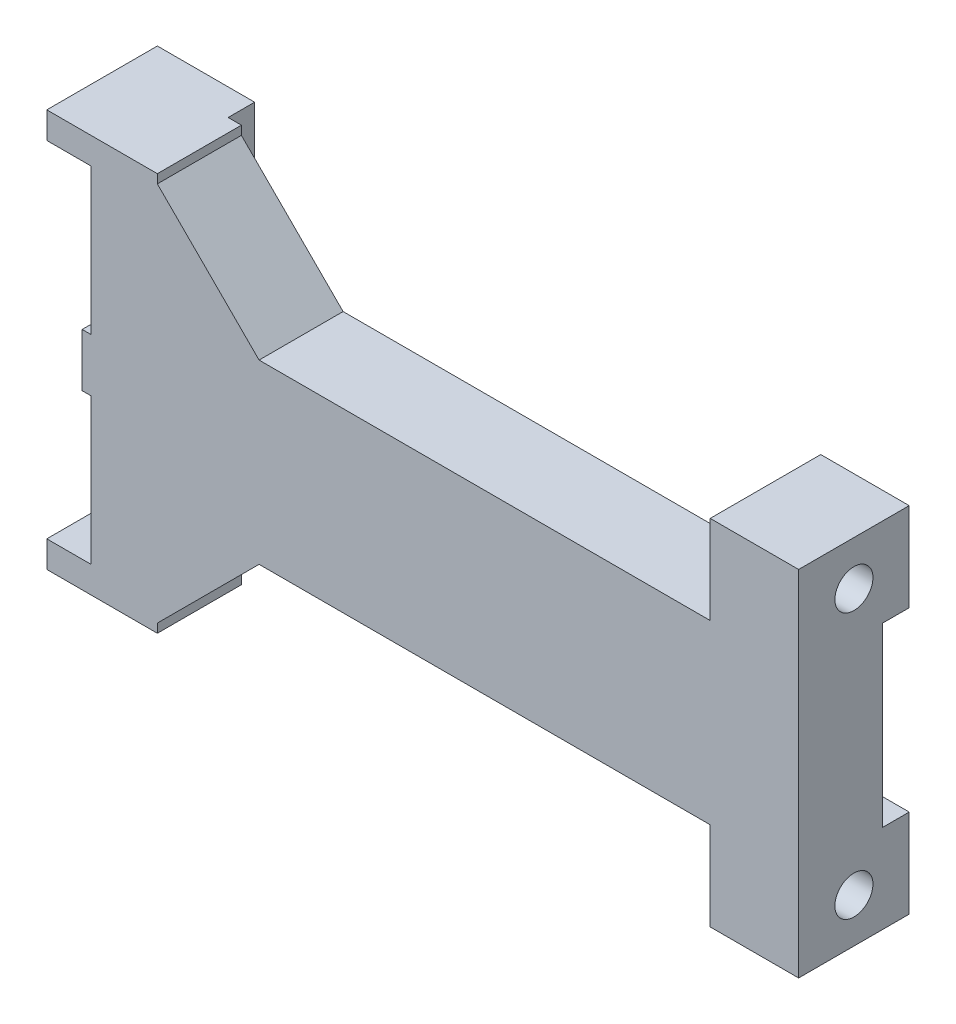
ISO-10303-21;
HEADER;
FILE_DESCRIPTION(('STEP AP214'),'2;1');
FILE_NAME('part.step','',(''),(''),'','','');
FILE_SCHEMA(('AUTOMOTIVE_DESIGN { 1 0 10303 214 1 1 1 1 }'));
ENDSEC;
DATA;
#1=APPLICATION_CONTEXT('core data for automotive mechanical design processes');
#2=APPLICATION_PROTOCOL_DEFINITION('international standard','automotive_design',2000,#1);
#3=PRODUCT_CONTEXT('',#1,'mechanical');
#4=PRODUCT('Part','Part','',(#3));
#5=PRODUCT_RELATED_PRODUCT_CATEGORY('part','',(#4));
#6=PRODUCT_DEFINITION_FORMATION('','',#4);
#7=PRODUCT_DEFINITION_CONTEXT('part definition',#1,'design');
#8=PRODUCT_DEFINITION('design','',#6,#7);
#9=PRODUCT_DEFINITION_SHAPE('','',#8);
#10=(LENGTH_UNIT() NAMED_UNIT(*) SI_UNIT(.MILLI.,.METRE.));
#11=(NAMED_UNIT(*) PLANE_ANGLE_UNIT() SI_UNIT($,.RADIAN.));
#12=(NAMED_UNIT(*) SI_UNIT($,.STERADIAN.) SOLID_ANGLE_UNIT());
#13=UNCERTAINTY_MEASURE_WITH_UNIT(LENGTH_MEASURE(1.E-05),#10,'distance_accuracy_value','');
#14=(GEOMETRIC_REPRESENTATION_CONTEXT(3) GLOBAL_UNCERTAINTY_ASSIGNED_CONTEXT((#13)) GLOBAL_UNIT_ASSIGNED_CONTEXT((#10,
#11,#12)) REPRESENTATION_CONTEXT('',''));
#15=CARTESIAN_POINT('',(0.,0.,0.));
#16=DIRECTION('',(0.,0.,1.));
#17=DIRECTION('',(1.,0.,0.));
#18=AXIS2_PLACEMENT_3D('',#15,#16,#17);
#19=CARTESIAN_POINT('',(-148.,296.054588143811,0.));
#20=DIRECTION('',(1.,0.,0.));
#21=DIRECTION('',(0.,0.,-1.));
#22=AXIS2_PLACEMENT_3D('',#19,#20,#21);
#23=PLANE('',#22);
#24=CARTESIAN_POINT('',(-148.,290.054588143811,19.));
#25=DIRECTION('',(-1.,0.,0.));
#26=DIRECTION('',(0.,0.,1.));
#27=AXIS2_PLACEMENT_3D('',#24,#25,#26);
#28=CIRCLE('',#27,2.1);
#29=CARTESIAN_POINT('',(-148.,290.054588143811,21.1));
#30=VERTEX_POINT('',#29);
#31=EDGE_CURVE('E348',#30,#30,#28,.T.);
#32=ORIENTED_EDGE('',*,*,#31,.F.);
#33=EDGE_LOOP('',(#32));
#34=FACE_BOUND('',#33,.T.);
#35=CARTESIAN_POINT('',(-148.,277.054588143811,19.));
#36=DIRECTION('',(-1.,0.,0.));
#37=DIRECTION('',(0.,0.,1.));
#38=AXIS2_PLACEMENT_3D('',#35,#36,#37);
#39=CIRCLE('',#38,2.1);
#40=CARTESIAN_POINT('',(-148.,277.054588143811,21.1));
#41=VERTEX_POINT('',#40);
#42=EDGE_CURVE('E342',#41,#41,#39,.T.);
#43=ORIENTED_EDGE('',*,*,#42,.F.);
#44=EDGE_LOOP('',(#43));
#45=FACE_BOUND('',#44,.T.);
#46=CARTESIAN_POINT('',(-148.,290.054588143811,6.5));
#47=DIRECTION('',(-1.,0.,0.));
#48=DIRECTION('',(0.,0.,1.));
#49=AXIS2_PLACEMENT_3D('',#46,#47,#48);
#50=CIRCLE('',#49,2.1);
#51=CARTESIAN_POINT('',(-148.,290.054588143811,8.6));
#52=VERTEX_POINT('',#51);
#53=EDGE_CURVE('E325',#52,#52,#50,.T.);
#54=ORIENTED_EDGE('',*,*,#53,.F.);
#55=EDGE_LOOP('',(#54));
#56=FACE_BOUND('',#55,.T.);
#57=CARTESIAN_POINT('',(-148.,277.054588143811,6.5));
#58=DIRECTION('',(-1.,0.,0.));
#59=DIRECTION('',(0.,0.,1.));
#60=AXIS2_PLACEMENT_3D('',#57,#58,#59);
#61=CIRCLE('',#60,2.1);
#62=CARTESIAN_POINT('',(-148.,277.054588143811,8.6));
#63=VERTEX_POINT('',#62);
#64=EDGE_CURVE('E320',#63,#63,#61,.T.);
#65=ORIENTED_EDGE('',*,*,#64,.F.);
#66=EDGE_LOOP('',(#65));
#67=FACE_BOUND('',#66,.T.);
#68=DIRECTION('',(0.,1.,0.));
#69=VECTOR('',#68,1.);
#70=CARTESIAN_POINT('',(-148.,296.054588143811,0.));
#71=LINE('',#70,#69);
#72=CARTESIAN_POINT('',(-148.,263.054588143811,0.));
#73=VERTEX_POINT('',#72);
#74=CARTESIAN_POINT('',(-148.,296.054588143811,0.));
#75=VERTEX_POINT('',#74);
#76=EDGE_CURVE('E31',#73,#75,#71,.T.);
#77=ORIENTED_EDGE('',*,*,#76,.F.);
#78=DIRECTION('',(0.,0.,1.));
#79=VECTOR('',#78,1.);
#80=CARTESIAN_POINT('',(-148.,263.054588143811,0.));
#81=LINE('',#80,#79);
#82=CARTESIAN_POINT('',(-148.,263.054588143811,25.));
#83=VERTEX_POINT('',#82);
#84=EDGE_CURVE('E303',#73,#83,#81,.T.);
#85=ORIENTED_EDGE('',*,*,#84,.T.);
#86=DIRECTION('',(0.,1.,0.));
#87=VECTOR('',#86,1.);
#88=CARTESIAN_POINT('',(-148.,296.054588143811,25.));
#89=LINE('',#88,#87);
#90=CARTESIAN_POINT('',(-148.,296.054588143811,25.));
#91=VERTEX_POINT('',#90);
#92=EDGE_CURVE('E434',#83,#91,#89,.T.);
#93=ORIENTED_EDGE('',*,*,#92,.T.);
#94=DIRECTION('',(0.,0.,1.));
#95=VECTOR('',#94,1.);
#96=CARTESIAN_POINT('',(-148.,296.054588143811,0.));
#97=LINE('',#96,#95);
#98=EDGE_CURVE('E442',#75,#91,#97,.T.);
#99=ORIENTED_EDGE('',*,*,#98,.F.);
#100=EDGE_LOOP('',(#77,#85,#93,#99));
#101=FACE_BOUND('',#100,.T.);
#102=ADVANCED_FACE('F16',(#34,#45,#56,#67,#101),#23,.F.);
#103=CARTESIAN_POINT('',(-8.,297.054588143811,25.));
#104=DIRECTION('',(1.,0.,0.));
#105=DIRECTION('',(0.,1.,0.));
#106=AXIS2_PLACEMENT_3D('',#103,#104,#105);
#107=PLANE('',#106);
#108=CARTESIAN_POINT('',(-8.,227.05458814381,12.5));
#109=DIRECTION('',(1.,0.,0.));
#110=DIRECTION('',(0.,0.,-1.));
#111=AXIS2_PLACEMENT_3D('',#108,#109,#110);
#112=CIRCLE('',#111,4.3);
#113=CARTESIAN_POINT('',(-8.,227.05458814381,8.2));
#114=VERTEX_POINT('',#113);
#115=EDGE_CURVE('E420',#114,#114,#112,.T.);
#116=ORIENTED_EDGE('',*,*,#115,.T.);
#117=EDGE_LOOP('',(#116));
#118=FACE_BOUND('',#117,.T.);
#119=DIRECTION('',(0.,0.,-1.));
#120=VECTOR('',#119,1.);
#121=CARTESIAN_POINT('',(-8.,237.05458814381,25.));
#122=LINE('',#121,#120);
#123=CARTESIAN_POINT('',(-8.,237.05458814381,25.));
#124=VERTEX_POINT('',#123);
#125=CARTESIAN_POINT('',(-8.,237.05458814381,6.));
#126=VERTEX_POINT('',#125);
#127=EDGE_CURVE('E525',#124,#126,#122,.T.);
#128=ORIENTED_EDGE('',*,*,#127,.T.);
#129=DIRECTION('',(0.,0.,-1.));
#130=VECTOR('',#129,1.);
#131=CARTESIAN_POINT('',(-8.,237.05458814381,6.));
#132=LINE('',#131,#130);
#133=CARTESIAN_POINT('',(-8.,237.05458814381,0.));
#134=VERTEX_POINT('',#133);
#135=EDGE_CURVE('E366',#126,#134,#132,.T.);
#136=ORIENTED_EDGE('',*,*,#135,.T.);
#137=DIRECTION('',(0.,-1.,0.));
#138=VECTOR('',#137,1.);
#139=CARTESIAN_POINT('',(-8.,297.054588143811,0.));
#140=LINE('',#139,#138);
#141=CARTESIAN_POINT('',(-8.,217.05458814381,0.));
#142=VERTEX_POINT('',#141);
#143=EDGE_CURVE('E494',#134,#142,#140,.T.);
#144=ORIENTED_EDGE('',*,*,#143,.T.);
#145=DIRECTION('',(0.,0.,-1.));
#146=VECTOR('',#145,1.);
#147=CARTESIAN_POINT('',(-8.,217.05458814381,25.));
#148=LINE('',#147,#146);
#149=CARTESIAN_POINT('',(-8.,217.05458814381,25.));
#150=VERTEX_POINT('',#149);
#151=EDGE_CURVE('E522',#150,#142,#148,.T.);
#152=ORIENTED_EDGE('',*,*,#151,.F.);
#153=DIRECTION('',(0.,-1.,0.));
#154=VECTOR('',#153,1.);
#155=CARTESIAN_POINT('',(-8.,217.05458814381,25.));
#156=LINE('',#155,#154);
#157=EDGE_CURVE('E460',#124,#150,#156,.T.);
#158=ORIENTED_EDGE('',*,*,#157,.F.);
#159=EDGE_LOOP('',(#128,#136,#144,#152,#158));
#160=FACE_BOUND('',#159,.T.);
#161=ADVANCED_FACE('F608',(#118,#160),#107,.F.);
#162=CARTESIAN_POINT('',(0.,0.,0.));
#163=DIRECTION('',(0.,0.,-1.));
#164=DIRECTION('',(-1.,0.,0.));
#165=AXIS2_PLACEMENT_3D('',#162,#163,#164);
#166=PLANE('',#165);
#167=DIRECTION('',(-1.,0.,0.));
#168=VECTOR('',#167,1.);
#169=CARTESIAN_POINT('',(-8.,237.05458814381,0.));
#170=LINE('',#169,#168);
#171=CARTESIAN_POINT('',(12.,237.05458814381,0.));
#172=VERTEX_POINT('',#171);
#173=EDGE_CURVE('E359',#172,#134,#170,.T.);
#174=ORIENTED_EDGE('',*,*,#173,.F.);
#175=DIRECTION('',(0.,1.,0.));
#176=VECTOR('',#175,1.);
#177=CARTESIAN_POINT('',(12.,217.05458814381,0.));
#178=LINE('',#177,#176);
#179=CARTESIAN_POINT('',(12.,217.05458814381,0.));
#180=VERTEX_POINT('',#179);
#181=EDGE_CURVE('E488',#180,#172,#178,.T.);
#182=ORIENTED_EDGE('',*,*,#181,.F.);
#183=DIRECTION('',(1.,0.,0.));
#184=VECTOR('',#183,1.);
#185=CARTESIAN_POINT('',(12.,217.05458814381,0.));
#186=LINE('',#185,#184);
#187=EDGE_CURVE('E485',#142,#180,#186,.T.);
#188=ORIENTED_EDGE('',*,*,#187,.F.);
#189=ORIENTED_EDGE('',*,*,#143,.F.);
#190=EDGE_LOOP('',(#174,#182,#188,#189));
#191=FACE_BOUND('',#190,.T.);
#192=ADVANCED_FACE('F616',(#191),#166,.T.);
#193=DIRECTION('',(0.,-1.,0.));
#194=VECTOR('',#193,1.);
#195=CARTESIAN_POINT('',(-136.,302.054588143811,0.));
#196=LINE('',#195,#194);
#197=CARTESIAN_POINT('',(-136.,302.054588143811,0.));
#198=VERTEX_POINT('',#197);
#199=CARTESIAN_POINT('',(-136.,212.054588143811,0.));
#200=VERTEX_POINT('',#199);
#201=EDGE_CURVE('E383',#198,#200,#196,.T.);
#202=ORIENTED_EDGE('',*,*,#201,.T.);
#203=DIRECTION('',(1.,0.,0.));
#204=VECTOR('',#203,1.);
#205=CARTESIAN_POINT('',(-133.,212.054588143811,0.));
#206=LINE('',#205,#204);
#207=CARTESIAN_POINT('',(-158.,212.054588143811,0.));
#208=VERTEX_POINT('',#207);
#209=EDGE_CURVE('E482',#208,#200,#206,.T.);
#210=ORIENTED_EDGE('',*,*,#209,.F.);
#211=DIRECTION('',(0.,-1.,0.));
#212=VECTOR('',#211,1.);
#213=CARTESIAN_POINT('',(-158.,302.054588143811,0.));
#214=LINE('',#213,#212);
#215=CARTESIAN_POINT('',(-158.,218.05458814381,0.));
#216=VERTEX_POINT('',#215);
#217=EDGE_CURVE('E441',#216,#208,#214,.T.);
#218=ORIENTED_EDGE('',*,*,#217,.F.);
#219=DIRECTION('',(1.,0.,0.));
#220=VECTOR('',#219,1.);
#221=CARTESIAN_POINT('',(-158.,218.05458814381,0.));
#222=LINE('',#221,#220);
#223=CARTESIAN_POINT('',(-148.,218.05458814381,0.));
#224=VERTEX_POINT('',#223);
#225=EDGE_CURVE('E424',#216,#224,#222,.T.);
#226=ORIENTED_EDGE('',*,*,#225,.T.);
#227=CARTESIAN_POINT('',(-148.,251.054588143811,0.));
#228=VERTEX_POINT('',#227);
#229=EDGE_CURVE('E288',#224,#228,#71,.T.);
#230=ORIENTED_EDGE('',*,*,#229,.T.);
#231=DIRECTION('',(1.,0.,0.));
#232=VECTOR('',#231,1.);
#233=CARTESIAN_POINT('',(-150.,251.054588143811,0.));
#234=LINE('',#233,#232);
#235=CARTESIAN_POINT('',(-150.,251.054588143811,0.));
#236=VERTEX_POINT('',#235);
#237=EDGE_CURVE('E271',#236,#228,#234,.T.);
#238=ORIENTED_EDGE('',*,*,#237,.F.);
#239=DIRECTION('',(0.,-1.,0.));
#240=VECTOR('',#239,1.);
#241=CARTESIAN_POINT('',(-150.,263.054588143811,0.));
#242=LINE('',#241,#240);
#243=CARTESIAN_POINT('',(-150.,263.054588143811,0.));
#244=VERTEX_POINT('',#243);
#245=EDGE_CURVE('E285',#244,#236,#242,.T.);
#246=ORIENTED_EDGE('',*,*,#245,.F.);
#247=DIRECTION('',(-1.,0.,0.));
#248=VECTOR('',#247,1.);
#249=CARTESIAN_POINT('',(-150.,263.054588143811,0.));
#250=LINE('',#249,#248);
#251=EDGE_CURVE('E278',#73,#244,#250,.T.);
#252=ORIENTED_EDGE('',*,*,#251,.F.);
#253=ORIENTED_EDGE('',*,*,#76,.T.);
#254=DIRECTION('',(-1.,0.,0.));
#255=VECTOR('',#254,1.);
#256=CARTESIAN_POINT('',(-158.,296.054588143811,0.));
#257=LINE('',#256,#255);
#258=CARTESIAN_POINT('',(-158.,296.054588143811,0.));
#259=VERTEX_POINT('',#258);
#260=EDGE_CURVE('E428',#75,#259,#257,.T.);
#261=ORIENTED_EDGE('',*,*,#260,.T.);
#262=CARTESIAN_POINT('',(-158.,302.054588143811,0.));
#263=VERTEX_POINT('',#262);
#264=EDGE_CURVE('E479',#263,#259,#214,.T.);
#265=ORIENTED_EDGE('',*,*,#264,.F.);
#266=DIRECTION('',(-1.,0.,0.));
#267=VECTOR('',#266,1.);
#268=CARTESIAN_POINT('',(-133.,302.054588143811,0.));
#269=LINE('',#268,#267);
#270=EDGE_CURVE('E498',#198,#263,#269,.T.);
#271=ORIENTED_EDGE('',*,*,#270,.F.);
#272=EDGE_LOOP('',(#202,#210,#218,#226,#230,#238,#246,#252,#253,#261,#265,#271));
#273=FACE_BOUND('',#272,.T.);
#274=ADVANCED_FACE('F283',(#273),#166,.T.);
#275=CARTESIAN_POINT('',(-158.,302.054588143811,25.));
#276=DIRECTION('',(1.,0.,0.));
#277=DIRECTION('',(0.,0.,-1.));
#278=AXIS2_PLACEMENT_3D('',#275,#276,#277);
#279=PLANE('',#278);
#280=ORIENTED_EDGE('',*,*,#264,.T.);
#281=DIRECTION('',(0.,0.,1.));
#282=VECTOR('',#281,1.);
#283=CARTESIAN_POINT('',(-158.,296.054588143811,0.));
#284=LINE('',#283,#282);
#285=CARTESIAN_POINT('',(-158.,296.054588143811,25.));
#286=VERTEX_POINT('',#285);
#287=EDGE_CURVE('E438',#259,#286,#284,.T.);
#288=ORIENTED_EDGE('',*,*,#287,.T.);
#289=DIRECTION('',(0.,-1.,0.));
#290=VECTOR('',#289,1.);
#291=CARTESIAN_POINT('',(-158.,302.054588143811,25.));
#292=LINE('',#291,#290);
#293=CARTESIAN_POINT('',(-158.,302.054588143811,25.));
#294=VERTEX_POINT('',#293);
#295=EDGE_CURVE('E448',#294,#286,#292,.T.);
#296=ORIENTED_EDGE('',*,*,#295,.F.);
#297=DIRECTION('',(0.,0.,-1.));
#298=VECTOR('',#297,1.);
#299=CARTESIAN_POINT('',(-158.,302.054588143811,25.));
#300=LINE('',#299,#298);
#301=EDGE_CURVE('E478',#294,#263,#300,.T.);
#302=ORIENTED_EDGE('',*,*,#301,.T.);
#303=EDGE_LOOP('',(#280,#288,#296,#302));
#304=FACE_BOUND('',#303,.T.);
#305=ADVANCED_FACE('F657',(#304),#279,.F.);
#306=CARTESIAN_POINT('',(-158.,218.05458814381,25.));
#307=VERTEX_POINT('',#306);
#308=CARTESIAN_POINT('',(-158.,212.054588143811,25.));
#309=VERTEX_POINT('',#308);
#310=EDGE_CURVE('E452',#307,#309,#292,.T.);
#311=ORIENTED_EDGE('',*,*,#310,.F.);
#312=DIRECTION('',(0.,0.,1.));
#313=VECTOR('',#312,1.);
#314=CARTESIAN_POINT('',(-158.,218.05458814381,0.));
#315=LINE('',#314,#313);
#316=EDGE_CURVE('E431',#216,#307,#315,.T.);
#317=ORIENTED_EDGE('',*,*,#316,.F.);
#318=ORIENTED_EDGE('',*,*,#217,.T.);
#319=DIRECTION('',(0.,0.,-1.));
#320=VECTOR('',#319,1.);
#321=CARTESIAN_POINT('',(-158.,212.054588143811,25.));
#322=LINE('',#321,#320);
#323=EDGE_CURVE('E537',#309,#208,#322,.T.);
#324=ORIENTED_EDGE('',*,*,#323,.F.);
#325=EDGE_LOOP('',(#311,#317,#318,#324));
#326=FACE_BOUND('',#325,.T.);
#327=ADVANCED_FACE('F18',(#326),#279,.F.);
#328=CARTESIAN_POINT('',(-133.,212.054588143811,25.));
#329=DIRECTION('',(0.,1.,0.));
#330=DIRECTION('',(0.,0.,1.));
#331=AXIS2_PLACEMENT_3D('',#328,#329,#330);
#332=PLANE('',#331);
#333=ORIENTED_EDGE('',*,*,#209,.T.);
#334=DIRECTION('',(0.,0.,-1.));
#335=VECTOR('',#334,1.);
#336=CARTESIAN_POINT('',(-136.,212.054588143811,0.));
#337=LINE('',#336,#335);
#338=CARTESIAN_POINT('',(-136.,212.054588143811,6.));
#339=VERTEX_POINT('',#338);
#340=EDGE_CURVE('E369',#339,#200,#337,.T.);
#341=ORIENTED_EDGE('',*,*,#340,.F.);
#342=DIRECTION('',(-1.,0.,0.));
#343=VECTOR('',#342,1.);
#344=CARTESIAN_POINT('',(-136.,212.054588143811,6.));
#345=LINE('',#344,#343);
#346=CARTESIAN_POINT('',(-133.,212.054588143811,6.));
#347=VERTEX_POINT('',#346);
#348=EDGE_CURVE('E380',#347,#339,#345,.T.);
#349=ORIENTED_EDGE('',*,*,#348,.F.);
#350=DIRECTION('',(0.,0.,-1.));
#351=VECTOR('',#350,1.);
#352=CARTESIAN_POINT('',(-133.,212.054588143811,25.));
#353=LINE('',#352,#351);
#354=CARTESIAN_POINT('',(-133.,212.054588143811,25.));
#355=VERTEX_POINT('',#354);
#356=EDGE_CURVE('E534',#355,#347,#353,.T.);
#357=ORIENTED_EDGE('',*,*,#356,.F.);
#358=DIRECTION('',(1.,0.,0.));
#359=VECTOR('',#358,1.);
#360=CARTESIAN_POINT('',(-133.,212.054588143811,25.));
#361=LINE('',#360,#359);
#362=EDGE_CURVE('E451',#309,#355,#361,.T.);
#363=ORIENTED_EDGE('',*,*,#362,.F.);
#364=ORIENTED_EDGE('',*,*,#323,.T.);
#365=EDGE_LOOP('',(#333,#341,#349,#357,#363,#364));
#366=FACE_BOUND('',#365,.T.);
#367=ADVANCED_FACE('F671',(#366),#332,.F.);
#368=CARTESIAN_POINT('',(-133.,214.054588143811,25.));
#369=DIRECTION('',(-1.,0.,0.));
#370=DIRECTION('',(0.,0.,1.));
#371=AXIS2_PLACEMENT_3D('',#368,#369,#370);
#372=PLANE('',#371);
#373=ORIENTED_EDGE('',*,*,#356,.T.);
#374=DIRECTION('',(0.,1.,0.));
#375=VECTOR('',#374,1.);
#376=CARTESIAN_POINT('',(-133.,214.054588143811,6.));
#377=LINE('',#376,#375);
#378=CARTESIAN_POINT('',(-133.,214.054588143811,6.));
#379=VERTEX_POINT('',#378);
#380=EDGE_CURVE('E408',#347,#379,#377,.T.);
#381=ORIENTED_EDGE('',*,*,#380,.T.);
#382=DIRECTION('',(0.,0.,-1.));
#383=VECTOR('',#382,1.);
#384=CARTESIAN_POINT('',(-133.,214.054588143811,25.));
#385=LINE('',#384,#383);
#386=CARTESIAN_POINT('',(-133.,214.054588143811,25.));
#387=VERTEX_POINT('',#386);
#388=EDGE_CURVE('E531',#387,#379,#385,.T.);
#389=ORIENTED_EDGE('',*,*,#388,.F.);
#390=DIRECTION('',(0.,1.,0.));
#391=VECTOR('',#390,1.);
#392=CARTESIAN_POINT('',(-133.,214.054588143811,25.));
#393=LINE('',#392,#391);
#394=EDGE_CURVE('E454',#355,#387,#393,.T.);
#395=ORIENTED_EDGE('',*,*,#394,.F.);
#396=EDGE_LOOP('',(#373,#381,#389,#395));
#397=FACE_BOUND('',#396,.T.);
#398=ADVANCED_FACE('F682',(#397),#372,.F.);
#399=CARTESIAN_POINT('',(-110.,237.05458814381,25.));
#400=DIRECTION('',(-0.707106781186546,0.707106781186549,0.));
#401=DIRECTION('',(-0.707106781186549,-0.707106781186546,0.));
#402=AXIS2_PLACEMENT_3D('',#399,#400,#401);
#403=PLANE('',#402);
#404=ORIENTED_EDGE('',*,*,#388,.T.);
#405=DIRECTION('',(0.707106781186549,0.707106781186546,0.));
#406=VECTOR('',#405,1.);
#407=CARTESIAN_POINT('',(-110.,237.05458814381,6.));
#408=LINE('',#407,#406);
#409=CARTESIAN_POINT('',(-110.,237.05458814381,6.));
#410=VERTEX_POINT('',#409);
#411=EDGE_CURVE('E405',#379,#410,#408,.T.);
#412=ORIENTED_EDGE('',*,*,#411,.T.);
#413=DIRECTION('',(0.,0.,-1.));
#414=VECTOR('',#413,1.);
#415=CARTESIAN_POINT('',(-110.,237.05458814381,25.));
#416=LINE('',#415,#414);
#417=CARTESIAN_POINT('',(-110.,237.05458814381,25.));
#418=VERTEX_POINT('',#417);
#419=EDGE_CURVE('E528',#418,#410,#416,.T.);
#420=ORIENTED_EDGE('',*,*,#419,.F.);
#421=DIRECTION('',(0.707106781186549,0.707106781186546,0.));
#422=VECTOR('',#421,1.);
#423=CARTESIAN_POINT('',(-110.,237.05458814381,25.));
#424=LINE('',#423,#422);
#425=EDGE_CURVE('E456',#387,#418,#424,.T.);
#426=ORIENTED_EDGE('',*,*,#425,.F.);
#427=EDGE_LOOP('',(#404,#412,#420,#426));
#428=FACE_BOUND('',#427,.T.);
#429=ADVANCED_FACE('F686',(#428),#403,.F.);
#430=CARTESIAN_POINT('',(-8.,237.05458814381,25.));
#431=DIRECTION('',(0.,1.,0.));
#432=DIRECTION('',(0.,0.,1.));
#433=AXIS2_PLACEMENT_3D('',#430,#431,#432);
#434=PLANE('',#433);
#435=ORIENTED_EDGE('',*,*,#419,.T.);
#436=DIRECTION('',(1.,0.,0.));
#437=VECTOR('',#436,1.);
#438=CARTESIAN_POINT('',(-8.,237.05458814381,6.));
#439=LINE('',#438,#437);
#440=EDGE_CURVE('E402',#410,#126,#439,.T.);
#441=ORIENTED_EDGE('',*,*,#440,.T.);
#442=ORIENTED_EDGE('',*,*,#127,.F.);
#443=DIRECTION('',(1.,0.,0.));
#444=VECTOR('',#443,1.);
#445=CARTESIAN_POINT('',(-8.,237.05458814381,25.));
#446=LINE('',#445,#444);
#447=EDGE_CURVE('E458',#418,#124,#446,.T.);
#448=ORIENTED_EDGE('',*,*,#447,.F.);
#449=EDGE_LOOP('',(#435,#441,#442,#448));
#450=FACE_BOUND('',#449,.T.);
#451=ADVANCED_FACE('F692',(#450),#434,.F.);
#452=CARTESIAN_POINT('',(12.,217.05458814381,25.));
#453=DIRECTION('',(0.,1.,0.));
#454=DIRECTION('',(0.,0.,1.));
#455=AXIS2_PLACEMENT_3D('',#452,#453,#454);
#456=PLANE('',#455);
#457=ORIENTED_EDGE('',*,*,#187,.T.);
#458=DIRECTION('',(0.,0.,-1.));
#459=VECTOR('',#458,1.);
#460=CARTESIAN_POINT('',(12.,217.05458814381,25.));
#461=LINE('',#460,#459);
#462=CARTESIAN_POINT('',(12.,217.05458814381,25.));
#463=VERTEX_POINT('',#462);
#464=EDGE_CURVE('E519',#463,#180,#461,.T.);
#465=ORIENTED_EDGE('',*,*,#464,.F.);
#466=DIRECTION('',(1.,0.,0.));
#467=VECTOR('',#466,1.);
#468=CARTESIAN_POINT('',(12.,217.05458814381,25.));
#469=LINE('',#468,#467);
#470=EDGE_CURVE('E462',#150,#463,#469,.T.);
#471=ORIENTED_EDGE('',*,*,#470,.F.);
#472=ORIENTED_EDGE('',*,*,#151,.T.);
#473=EDGE_LOOP('',(#457,#465,#471,#472));
#474=FACE_BOUND('',#473,.T.);
#475=ADVANCED_FACE('F699',(#474),#456,.F.);
#476=CARTESIAN_POINT('',(12.,217.05458814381,25.));
#477=DIRECTION('',(-1.,0.,0.));
#478=DIRECTION('',(0.,-1.,0.));
#479=AXIS2_PLACEMENT_3D('',#476,#477,#478);
#480=PLANE('',#479);
#481=ORIENTED_EDGE('',*,*,#181,.T.);
#482=DIRECTION('',(0.,0.,-1.));
#483=VECTOR('',#482,1.);
#484=CARTESIAN_POINT('',(12.,237.05458814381,6.));
#485=LINE('',#484,#483);
#486=CARTESIAN_POINT('',(12.,237.05458814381,6.));
#487=VERTEX_POINT('',#486);
#488=EDGE_CURVE('E370',#487,#172,#485,.T.);
#489=ORIENTED_EDGE('',*,*,#488,.F.);
#490=DIRECTION('',(0.,-1.,0.));
#491=VECTOR('',#490,1.);
#492=CARTESIAN_POINT('',(12.,277.054588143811,6.));
#493=LINE('',#492,#491);
#494=CARTESIAN_POINT('',(12.,277.054588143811,6.));
#495=VERTEX_POINT('',#494);
#496=EDGE_CURVE('E358',#495,#487,#493,.T.);
#497=ORIENTED_EDGE('',*,*,#496,.F.);
#498=DIRECTION('',(0.,0.,-1.));
#499=VECTOR('',#498,1.);
#500=CARTESIAN_POINT('',(12.,277.054588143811,6.));
#501=LINE('',#500,#499);
#502=CARTESIAN_POINT('',(12.,277.054588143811,0.));
#503=VERTEX_POINT('',#502);
#504=EDGE_CURVE('E372',#495,#503,#501,.T.);
#505=ORIENTED_EDGE('',*,*,#504,.T.);
#506=CARTESIAN_POINT('',(12.,297.054588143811,0.));
#507=VERTEX_POINT('',#506);
#508=EDGE_CURVE('E487',#503,#507,#178,.T.);
#509=ORIENTED_EDGE('',*,*,#508,.T.);
#510=DIRECTION('',(0.,0.,-1.));
#511=VECTOR('',#510,1.);
#512=CARTESIAN_POINT('',(12.,297.054588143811,25.));
#513=LINE('',#512,#511);
#514=CARTESIAN_POINT('',(12.,297.054588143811,25.));
#515=VERTEX_POINT('',#514);
#516=EDGE_CURVE('E516',#515,#507,#513,.T.);
#517=ORIENTED_EDGE('',*,*,#516,.F.);
#518=DIRECTION('',(0.,1.,0.));
#519=VECTOR('',#518,1.);
#520=CARTESIAN_POINT('',(12.,217.05458814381,25.));
#521=LINE('',#520,#519);
#522=EDGE_CURVE('E464',#463,#515,#521,.T.);
#523=ORIENTED_EDGE('',*,*,#522,.F.);
#524=ORIENTED_EDGE('',*,*,#464,.T.);
#525=EDGE_LOOP('',(#481,#489,#497,#505,#509,#517,#523,#524));
#526=FACE_BOUND('',#525,.T.);
#527=CARTESIAN_POINT('',(12.,287.054588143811,12.5));
#528=DIRECTION('',(1.,0.,0.));
#529=DIRECTION('',(0.,0.,-1.));
#530=AXIS2_PLACEMENT_3D('',#527,#528,#529);
#531=CIRCLE('',#530,4.3);
#532=CARTESIAN_POINT('',(12.,287.054588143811,8.2));
#533=VERTEX_POINT('',#532);
#534=EDGE_CURVE('E411',#533,#533,#531,.T.);
#535=ORIENTED_EDGE('',*,*,#534,.F.);
#536=EDGE_LOOP('',(#535));
#537=FACE_BOUND('',#536,.T.);
#538=CARTESIAN_POINT('',(12.,227.05458814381,12.5));
#539=DIRECTION('',(1.,0.,0.));
#540=DIRECTION('',(0.,0.,-1.));
#541=AXIS2_PLACEMENT_3D('',#538,#539,#540);
#542=CIRCLE('',#541,4.3);
#543=CARTESIAN_POINT('',(12.,227.05458814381,8.2));
#544=VERTEX_POINT('',#543);
#545=EDGE_CURVE('E417',#544,#544,#542,.T.);
#546=ORIENTED_EDGE('',*,*,#545,.F.);
#547=EDGE_LOOP('',(#546));
#548=FACE_BOUND('',#547,.T.);
#549=ADVANCED_FACE('F705',(#526,#537,#548),#480,.F.);
#550=CARTESIAN_POINT('',(12.,297.054588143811,25.));
#551=DIRECTION('',(0.,-1.,0.));
#552=DIRECTION('',(0.,0.,-1.));
#553=AXIS2_PLACEMENT_3D('',#550,#551,#552);
#554=PLANE('',#553);
#555=DIRECTION('',(-1.,0.,0.));
#556=VECTOR('',#555,1.);
#557=CARTESIAN_POINT('',(12.,297.054588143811,0.));
#558=LINE('',#557,#556);
#559=CARTESIAN_POINT('',(-8.,297.054588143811,0.));
#560=VERTEX_POINT('',#559);
#561=EDGE_CURVE('E491',#507,#560,#558,.T.);
#562=ORIENTED_EDGE('',*,*,#561,.T.);
#563=DIRECTION('',(0.,0.,-1.));
#564=VECTOR('',#563,1.);
#565=CARTESIAN_POINT('',(-8.,297.054588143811,25.));
#566=LINE('',#565,#564);
#567=CARTESIAN_POINT('',(-8.,297.054588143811,25.));
#568=VERTEX_POINT('',#567);
#569=EDGE_CURVE('E514',#568,#560,#566,.T.);
#570=ORIENTED_EDGE('',*,*,#569,.F.);
#571=DIRECTION('',(-1.,0.,0.));
#572=VECTOR('',#571,1.);
#573=CARTESIAN_POINT('',(12.,297.054588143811,25.));
#574=LINE('',#573,#572);
#575=EDGE_CURVE('E466',#515,#568,#574,.T.);
#576=ORIENTED_EDGE('',*,*,#575,.F.);
#577=ORIENTED_EDGE('',*,*,#516,.T.);
#578=EDGE_LOOP('',(#562,#570,#576,#577));
#579=FACE_BOUND('',#578,.T.);
#580=ADVANCED_FACE('F710',(#579),#554,.F.);
#581=CARTESIAN_POINT('',(-8.,287.054588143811,12.5));
#582=DIRECTION('',(1.,0.,0.));
#583=DIRECTION('',(0.,0.,-1.));
#584=AXIS2_PLACEMENT_3D('',#581,#582,#583);
#585=CIRCLE('',#584,4.3);
#586=CARTESIAN_POINT('',(-8.,287.054588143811,8.2));
#587=VERTEX_POINT('',#586);
#588=EDGE_CURVE('E414',#587,#587,#585,.T.);
#589=ORIENTED_EDGE('',*,*,#588,.T.);
#590=EDGE_LOOP('',(#589));
#591=FACE_BOUND('',#590,.T.);
#592=CARTESIAN_POINT('',(-8.,277.054588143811,0.));
#593=VERTEX_POINT('',#592);
#594=EDGE_CURVE('E495',#560,#593,#140,.T.);
#595=ORIENTED_EDGE('',*,*,#594,.T.);
#596=DIRECTION('',(0.,0.,-1.));
#597=VECTOR('',#596,1.);
#598=CARTESIAN_POINT('',(-8.,277.054588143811,6.));
#599=LINE('',#598,#597);
#600=CARTESIAN_POINT('',(-8.,277.054588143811,6.));
#601=VERTEX_POINT('',#600);
#602=EDGE_CURVE('E363',#601,#593,#599,.T.);
#603=ORIENTED_EDGE('',*,*,#602,.F.);
#604=DIRECTION('',(0.,0.,-1.));
#605=VECTOR('',#604,1.);
#606=CARTESIAN_POINT('',(-8.,277.054588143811,25.));
#607=LINE('',#606,#605);
#608=CARTESIAN_POINT('',(-8.,277.054588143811,25.));
#609=VERTEX_POINT('',#608);
#610=EDGE_CURVE('E511',#609,#601,#607,.T.);
#611=ORIENTED_EDGE('',*,*,#610,.F.);
#612=DIRECTION('',(0.,-1.,0.));
#613=VECTOR('',#612,1.);
#614=CARTESIAN_POINT('',(-8.,297.054588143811,25.));
#615=LINE('',#614,#613);
#616=EDGE_CURVE('E468',#568,#609,#615,.T.);
#617=ORIENTED_EDGE('',*,*,#616,.F.);
#618=ORIENTED_EDGE('',*,*,#569,.T.);
#619=EDGE_LOOP('',(#595,#603,#611,#617,#618));
#620=FACE_BOUND('',#619,.T.);
#621=ADVANCED_FACE('F619',(#591,#620),#107,.F.);
#622=CARTESIAN_POINT('',(-8.,277.054588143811,25.));
#623=DIRECTION('',(0.,-1.,0.));
#624=DIRECTION('',(0.,0.,-1.));
#625=AXIS2_PLACEMENT_3D('',#622,#623,#624);
#626=PLANE('',#625);
#627=ORIENTED_EDGE('',*,*,#610,.T.);
#628=DIRECTION('',(-1.,0.,0.));
#629=VECTOR('',#628,1.);
#630=CARTESIAN_POINT('',(-8.,277.054588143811,6.));
#631=LINE('',#630,#629);
#632=CARTESIAN_POINT('',(-110.,277.054588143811,6.));
#633=VERTEX_POINT('',#632);
#634=EDGE_CURVE('E399',#601,#633,#631,.T.);
#635=ORIENTED_EDGE('',*,*,#634,.T.);
#636=DIRECTION('',(0.,0.,-1.));
#637=VECTOR('',#636,1.);
#638=CARTESIAN_POINT('',(-110.,277.054588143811,25.));
#639=LINE('',#638,#637);
#640=CARTESIAN_POINT('',(-110.,277.054588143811,25.));
#641=VERTEX_POINT('',#640);
#642=EDGE_CURVE('E508',#641,#633,#639,.T.);
#643=ORIENTED_EDGE('',*,*,#642,.F.);
#644=DIRECTION('',(-1.,0.,0.));
#645=VECTOR('',#644,1.);
#646=CARTESIAN_POINT('',(-8.,277.054588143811,25.));
#647=LINE('',#646,#645);
#648=EDGE_CURVE('E470',#609,#641,#647,.T.);
#649=ORIENTED_EDGE('',*,*,#648,.F.);
#650=EDGE_LOOP('',(#627,#635,#643,#649));
#651=FACE_BOUND('',#650,.T.);
#652=ADVANCED_FACE('F721',(#651),#626,.F.);
#653=CARTESIAN_POINT('',(-110.,277.054588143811,25.));
#654=DIRECTION('',(-0.707106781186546,-0.707106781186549,0.));
#655=DIRECTION('',(0.707106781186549,-0.707106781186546,0.));
#656=AXIS2_PLACEMENT_3D('',#653,#654,#655);
#657=PLANE('',#656);
#658=ORIENTED_EDGE('',*,*,#642,.T.);
#659=DIRECTION('',(-0.707106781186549,0.707106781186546,0.));
#660=VECTOR('',#659,1.);
#661=CARTESIAN_POINT('',(-110.,277.054588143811,6.));
#662=LINE('',#661,#660);
#663=CARTESIAN_POINT('',(-133.,300.054588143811,6.));
#664=VERTEX_POINT('',#663);
#665=EDGE_CURVE('E396',#633,#664,#662,.T.);
#666=ORIENTED_EDGE('',*,*,#665,.T.);
#667=DIRECTION('',(0.,0.,-1.));
#668=VECTOR('',#667,1.);
#669=CARTESIAN_POINT('',(-133.,300.054588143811,25.));
#670=LINE('',#669,#668);
#671=CARTESIAN_POINT('',(-133.,300.054588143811,25.));
#672=VERTEX_POINT('',#671);
#673=EDGE_CURVE('E505',#672,#664,#670,.T.);
#674=ORIENTED_EDGE('',*,*,#673,.F.);
#675=DIRECTION('',(-0.707106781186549,0.707106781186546,0.));
#676=VECTOR('',#675,1.);
#677=CARTESIAN_POINT('',(-110.,277.054588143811,25.));
#678=LINE('',#677,#676);
#679=EDGE_CURVE('E472',#641,#672,#678,.T.);
#680=ORIENTED_EDGE('',*,*,#679,.F.);
#681=EDGE_LOOP('',(#658,#666,#674,#680));
#682=FACE_BOUND('',#681,.T.);
#683=ADVANCED_FACE('F724',(#682),#657,.F.);
#684=CARTESIAN_POINT('',(-133.,300.054588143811,25.));
#685=DIRECTION('',(-1.,0.,0.));
#686=DIRECTION('',(0.,0.,1.));
#687=AXIS2_PLACEMENT_3D('',#684,#685,#686);
#688=PLANE('',#687);
#689=ORIENTED_EDGE('',*,*,#673,.T.);
#690=DIRECTION('',(0.,1.,0.));
#691=VECTOR('',#690,1.);
#692=CARTESIAN_POINT('',(-133.,300.054588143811,6.));
#693=LINE('',#692,#691);
#694=CARTESIAN_POINT('',(-133.,302.054588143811,6.));
#695=VERTEX_POINT('',#694);
#696=EDGE_CURVE('E390',#664,#695,#693,.T.);
#697=ORIENTED_EDGE('',*,*,#696,.T.);
#698=DIRECTION('',(0.,0.,-1.));
#699=VECTOR('',#698,1.);
#700=CARTESIAN_POINT('',(-133.,302.054588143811,25.));
#701=LINE('',#700,#699);
#702=CARTESIAN_POINT('',(-133.,302.054588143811,25.));
#703=VERTEX_POINT('',#702);
#704=EDGE_CURVE('E502',#703,#695,#701,.T.);
#705=ORIENTED_EDGE('',*,*,#704,.F.);
#706=DIRECTION('',(0.,1.,0.));
#707=VECTOR('',#706,1.);
#708=CARTESIAN_POINT('',(-133.,300.054588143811,25.));
#709=LINE('',#708,#707);
#710=EDGE_CURVE('E474',#672,#703,#709,.T.);
#711=ORIENTED_EDGE('',*,*,#710,.F.);
#712=EDGE_LOOP('',(#689,#697,#705,#711));
#713=FACE_BOUND('',#712,.T.);
#714=ADVANCED_FACE('F726',(#713),#688,.F.);
#715=CARTESIAN_POINT('',(-133.,302.054588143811,25.));
#716=DIRECTION('',(0.,-1.,0.));
#717=DIRECTION('',(0.,0.,-1.));
#718=AXIS2_PLACEMENT_3D('',#715,#716,#717);
#719=PLANE('',#718);
#720=DIRECTION('',(-1.,0.,0.));
#721=VECTOR('',#720,1.);
#722=CARTESIAN_POINT('',(-136.,302.054588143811,6.));
#723=LINE('',#722,#721);
#724=CARTESIAN_POINT('',(-136.,302.054588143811,6.));
#725=VERTEX_POINT('',#724);
#726=EDGE_CURVE('E379',#695,#725,#723,.T.);
#727=ORIENTED_EDGE('',*,*,#726,.T.);
#728=DIRECTION('',(0.,0.,-1.));
#729=VECTOR('',#728,1.);
#730=CARTESIAN_POINT('',(-136.,302.054588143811,0.));
#731=LINE('',#730,#729);
#732=EDGE_CURVE('E376',#725,#198,#731,.T.);
#733=ORIENTED_EDGE('',*,*,#732,.T.);
#734=ORIENTED_EDGE('',*,*,#270,.T.);
#735=ORIENTED_EDGE('',*,*,#301,.F.);
#736=DIRECTION('',(-1.,0.,0.));
#737=VECTOR('',#736,1.);
#738=CARTESIAN_POINT('',(-133.,302.054588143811,25.));
#739=LINE('',#738,#737);
#740=EDGE_CURVE('E476',#703,#294,#739,.T.);
#741=ORIENTED_EDGE('',*,*,#740,.F.);
#742=ORIENTED_EDGE('',*,*,#704,.T.);
#743=EDGE_LOOP('',(#727,#733,#734,#735,#741,#742));
#744=FACE_BOUND('',#743,.T.);
#745=ADVANCED_FACE('F663',(#744),#719,.F.);
#746=CARTESIAN_POINT('',(0.,0.,25.));
#747=DIRECTION('',(0.,0.,-1.));
#748=DIRECTION('',(-1.,0.,0.));
#749=AXIS2_PLACEMENT_3D('',#746,#747,#748);
#750=PLANE('',#749);
#751=ORIENTED_EDGE('',*,*,#295,.T.);
#752=DIRECTION('',(-1.,0.,0.));
#753=VECTOR('',#752,1.);
#754=CARTESIAN_POINT('',(-158.,296.054588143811,25.));
#755=LINE('',#754,#753);
#756=EDGE_CURVE('E426',#91,#286,#755,.T.);
#757=ORIENTED_EDGE('',*,*,#756,.F.);
#758=ORIENTED_EDGE('',*,*,#92,.F.);
#759=DIRECTION('',(-1.,0.,0.));
#760=VECTOR('',#759,1.);
#761=CARTESIAN_POINT('',(-150.,263.054588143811,25.));
#762=LINE('',#761,#760);
#763=CARTESIAN_POINT('',(-150.,263.054588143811,25.));
#764=VERTEX_POINT('',#763);
#765=EDGE_CURVE('E292',#83,#764,#762,.T.);
#766=ORIENTED_EDGE('',*,*,#765,.T.);
#767=DIRECTION('',(0.,-1.,0.));
#768=VECTOR('',#767,1.);
#769=CARTESIAN_POINT('',(-150.,263.054588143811,25.));
#770=LINE('',#769,#768);
#771=CARTESIAN_POINT('',(-150.,251.054588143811,25.));
#772=VERTEX_POINT('',#771);
#773=EDGE_CURVE('E298',#764,#772,#770,.T.);
#774=ORIENTED_EDGE('',*,*,#773,.T.);
#775=DIRECTION('',(1.,0.,0.));
#776=VECTOR('',#775,1.);
#777=CARTESIAN_POINT('',(-150.,251.054588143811,25.));
#778=LINE('',#777,#776);
#779=CARTESIAN_POINT('',(-148.,251.054588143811,25.));
#780=VERTEX_POINT('',#779);
#781=EDGE_CURVE('E273',#772,#780,#778,.T.);
#782=ORIENTED_EDGE('',*,*,#781,.T.);
#783=CARTESIAN_POINT('',(-148.,218.05458814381,25.));
#784=VERTEX_POINT('',#783);
#785=EDGE_CURVE('E435',#784,#780,#89,.T.);
#786=ORIENTED_EDGE('',*,*,#785,.F.);
#787=DIRECTION('',(1.,0.,0.));
#788=VECTOR('',#787,1.);
#789=CARTESIAN_POINT('',(-158.,218.05458814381,25.));
#790=LINE('',#789,#788);
#791=EDGE_CURVE('E423',#307,#784,#790,.T.);
#792=ORIENTED_EDGE('',*,*,#791,.F.);
#793=ORIENTED_EDGE('',*,*,#310,.T.);
#794=ORIENTED_EDGE('',*,*,#362,.T.);
#795=ORIENTED_EDGE('',*,*,#394,.T.);
#796=ORIENTED_EDGE('',*,*,#425,.T.);
#797=ORIENTED_EDGE('',*,*,#447,.T.);
#798=ORIENTED_EDGE('',*,*,#157,.T.);
#799=ORIENTED_EDGE('',*,*,#470,.T.);
#800=ORIENTED_EDGE('',*,*,#522,.T.);
#801=ORIENTED_EDGE('',*,*,#575,.T.);
#802=ORIENTED_EDGE('',*,*,#616,.T.);
#803=ORIENTED_EDGE('',*,*,#648,.T.);
#804=ORIENTED_EDGE('',*,*,#679,.T.);
#805=ORIENTED_EDGE('',*,*,#710,.T.);
#806=ORIENTED_EDGE('',*,*,#740,.T.);
#807=EDGE_LOOP('',(#751,#757,#758,#766,#774,#782,#786,#792,#793,#794,#795,#796,#797,#798,#799,
#800,#801,#802,#803,#804,#805,#806));
#808=FACE_BOUND('',#807,.T.);
#809=ADVANCED_FACE('F648',(#808),#750,.F.);
#810=DIRECTION('',(1.,0.,0.));
#811=VECTOR('',#810,1.);
#812=CARTESIAN_POINT('',(-8.,277.054588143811,0.));
#813=LINE('',#812,#811);
#814=EDGE_CURVE('E354',#593,#503,#813,.T.);
#815=ORIENTED_EDGE('',*,*,#814,.F.);
#816=ORIENTED_EDGE('',*,*,#594,.F.);
#817=ORIENTED_EDGE('',*,*,#561,.F.);
#818=ORIENTED_EDGE('',*,*,#508,.F.);
#819=EDGE_LOOP('',(#815,#816,#817,#818));
#820=FACE_BOUND('',#819,.T.);
#821=ADVANCED_FACE('F635',(#820),#166,.T.);
#822=CARTESIAN_POINT('',(-158.,296.054588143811,0.));
#823=DIRECTION('',(0.,1.,0.));
#824=DIRECTION('',(0.,0.,1.));
#825=AXIS2_PLACEMENT_3D('',#822,#823,#824);
#826=PLANE('',#825);
#827=ORIENTED_EDGE('',*,*,#756,.T.);
#828=ORIENTED_EDGE('',*,*,#287,.F.);
#829=ORIENTED_EDGE('',*,*,#260,.F.);
#830=ORIENTED_EDGE('',*,*,#98,.T.);
#831=EDGE_LOOP('',(#827,#828,#829,#830));
#832=FACE_BOUND('',#831,.T.);
#833=ADVANCED_FACE('F626',(#832),#826,.F.);
#834=CARTESIAN_POINT('',(-148.,224.05458814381,6.));
#835=DIRECTION('',(-1.,0.,0.));
#836=DIRECTION('',(0.,0.,1.));
#837=AXIS2_PLACEMENT_3D('',#834,#835,#836);
#838=CIRCLE('',#837,2.1);
#839=CARTESIAN_POINT('',(-148.,224.05458814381,8.1));
#840=VERTEX_POINT('',#839);
#841=EDGE_CURVE('E302',#840,#840,#838,.T.);
#842=ORIENTED_EDGE('',*,*,#841,.F.);
#843=EDGE_LOOP('',(#842));
#844=FACE_BOUND('',#843,.T.);
#845=CARTESIAN_POINT('',(-148.,237.05458814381,6.));
#846=DIRECTION('',(-1.,0.,0.));
#847=DIRECTION('',(0.,0.,1.));
#848=AXIS2_PLACEMENT_3D('',#845,#846,#847);
#849=CIRCLE('',#848,2.1);
#850=CARTESIAN_POINT('',(-148.,237.05458814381,8.1));
#851=VERTEX_POINT('',#850);
#852=EDGE_CURVE('E314',#851,#851,#849,.T.);
#853=ORIENTED_EDGE('',*,*,#852,.F.);
#854=EDGE_LOOP('',(#853));
#855=FACE_BOUND('',#854,.T.);
#856=CARTESIAN_POINT('',(-148.,224.05458814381,19.));
#857=DIRECTION('',(-1.,0.,0.));
#858=DIRECTION('',(0.,0.,1.));
#859=AXIS2_PLACEMENT_3D('',#856,#857,#858);
#860=CIRCLE('',#859,2.1);
#861=CARTESIAN_POINT('',(-148.,224.05458814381,21.1));
#862=VERTEX_POINT('',#861);
#863=EDGE_CURVE('E330',#862,#862,#860,.T.);
#864=ORIENTED_EDGE('',*,*,#863,.F.);
#865=EDGE_LOOP('',(#864));
#866=FACE_BOUND('',#865,.T.);
#867=CARTESIAN_POINT('',(-148.,237.05458814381,19.));
#868=DIRECTION('',(-1.,0.,0.));
#869=DIRECTION('',(0.,0.,1.));
#870=AXIS2_PLACEMENT_3D('',#867,#868,#869);
#871=CIRCLE('',#870,2.1);
#872=CARTESIAN_POINT('',(-148.,237.05458814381,21.1));
#873=VERTEX_POINT('',#872);
#874=EDGE_CURVE('E336',#873,#873,#871,.T.);
#875=ORIENTED_EDGE('',*,*,#874,.F.);
#876=EDGE_LOOP('',(#875));
#877=FACE_BOUND('',#876,.T.);
#878=ORIENTED_EDGE('',*,*,#785,.T.);
#879=DIRECTION('',(0.,0.,1.));
#880=VECTOR('',#879,1.);
#881=CARTESIAN_POINT('',(-148.,251.054588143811,0.));
#882=LINE('',#881,#880);
#883=EDGE_CURVE('E39',#228,#780,#882,.T.);
#884=ORIENTED_EDGE('',*,*,#883,.F.);
#885=ORIENTED_EDGE('',*,*,#229,.F.);
#886=DIRECTION('',(0.,0.,1.));
#887=VECTOR('',#886,1.);
#888=CARTESIAN_POINT('',(-148.,218.05458814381,0.));
#889=LINE('',#888,#887);
#890=EDGE_CURVE('E445',#224,#784,#889,.T.);
#891=ORIENTED_EDGE('',*,*,#890,.T.);
#892=EDGE_LOOP('',(#878,#884,#885,#891));
#893=FACE_BOUND('',#892,.T.);
#894=ADVANCED_FACE('F611',(#844,#855,#866,#877,#893),#23,.F.);
#895=CARTESIAN_POINT('',(-158.,218.05458814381,0.));
#896=DIRECTION('',(0.,-1.,0.));
#897=DIRECTION('',(0.,0.,-1.));
#898=AXIS2_PLACEMENT_3D('',#895,#896,#897);
#899=PLANE('',#898);
#900=ORIENTED_EDGE('',*,*,#791,.T.);
#901=ORIENTED_EDGE('',*,*,#890,.F.);
#902=ORIENTED_EDGE('',*,*,#225,.F.);
#903=ORIENTED_EDGE('',*,*,#316,.T.);
#904=EDGE_LOOP('',(#900,#901,#902,#903));
#905=FACE_BOUND('',#904,.T.);
#906=ADVANCED_FACE('F625',(#905),#899,.F.);
#907=CARTESIAN_POINT('',(12.,227.05458814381,12.5));
#908=DIRECTION('',(1.,0.,0.));
#909=DIRECTION('',(0.,0.,-1.));
#910=AXIS2_PLACEMENT_3D('',#907,#908,#909);
#911=CYLINDRICAL_SURFACE('',#910,4.3);
#912=ORIENTED_EDGE('',*,*,#115,.F.);
#913=EDGE_LOOP('',(#912));
#914=FACE_BOUND('',#913,.T.);
#915=ORIENTED_EDGE('',*,*,#545,.T.);
#916=EDGE_LOOP('',(#915));
#917=FACE_BOUND('',#916,.T.);
#918=ADVANCED_FACE('F633',(#914,#917),#911,.F.);
#919=CARTESIAN_POINT('',(12.,287.054588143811,12.5));
#920=DIRECTION('',(1.,0.,0.));
#921=DIRECTION('',(0.,0.,-1.));
#922=AXIS2_PLACEMENT_3D('',#919,#920,#921);
#923=CYLINDRICAL_SURFACE('',#922,4.3);
#924=ORIENTED_EDGE('',*,*,#588,.F.);
#925=EDGE_LOOP('',(#924));
#926=FACE_BOUND('',#925,.T.);
#927=ORIENTED_EDGE('',*,*,#534,.T.);
#928=EDGE_LOOP('',(#927));
#929=FACE_BOUND('',#928,.T.);
#930=ADVANCED_FACE('F742',(#926,#929),#923,.F.);
#931=CARTESIAN_POINT('',(-136.,302.054588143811,6.));
#932=DIRECTION('',(0.,0.,1.));
#933=DIRECTION('',(1.,0.,0.));
#934=AXIS2_PLACEMENT_3D('',#931,#932,#933);
#935=PLANE('',#934);
#936=DIRECTION('',(-0.515038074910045,0.857167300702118,0.));
#937=VECTOR('',#936,1.);
#938=CARTESIAN_POINT('',(-130.738192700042,224.05458814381,6.));
#939=LINE('',#938,#937);
#940=CARTESIAN_POINT('',(-130.738192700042,224.05458814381,6.));
#941=VERTEX_POINT('',#940);
#942=CARTESIAN_POINT('',(-132.,226.15458814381,6.));
#943=VERTEX_POINT('',#942);
#944=EDGE_CURVE('E847',#941,#943,#939,.T.);
#945=ORIENTED_EDGE('',*,*,#944,.T.);
#946=DIRECTION('',(-1.,0.,0.));
#947=VECTOR('',#946,1.);
#948=CARTESIAN_POINT('',(-148.,226.15458814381,6.));
#949=LINE('',#948,#947);
#950=CARTESIAN_POINT('',(-136.,226.15458814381,6.));
#951=VERTEX_POINT('',#950);
#952=EDGE_CURVE('E11',#943,#951,#949,.T.);
#953=ORIENTED_EDGE('',*,*,#952,.T.);
#954=DIRECTION('',(0.,-1.,0.));
#955=VECTOR('',#954,1.);
#956=CARTESIAN_POINT('',(-136.,302.054588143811,6.));
#957=LINE('',#956,#955);
#958=CARTESIAN_POINT('',(-136.,234.95458814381,6.));
#959=VERTEX_POINT('',#958);
#960=EDGE_CURVE('E736',#959,#951,#957,.T.);
#961=ORIENTED_EDGE('',*,*,#960,.F.);
#962=DIRECTION('',(-1.,0.,0.));
#963=VECTOR('',#962,1.);
#964=CARTESIAN_POINT('',(-148.,234.95458814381,6.));
#965=LINE('',#964,#963);
#966=CARTESIAN_POINT('',(-132.,234.95458814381,6.));
#967=VERTEX_POINT('',#966);
#968=EDGE_CURVE('E837',#959,#967,#965,.F.);
#969=ORIENTED_EDGE('',*,*,#968,.T.);
#970=DIRECTION('',(0.515038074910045,0.857167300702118,0.));
#971=VECTOR('',#970,1.);
#972=CARTESIAN_POINT('',(-130.738192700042,237.05458814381,6.));
#973=LINE('',#972,#971);
#974=CARTESIAN_POINT('',(-130.738192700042,237.05458814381,6.));
#975=VERTEX_POINT('',#974);
#976=EDGE_CURVE('E827',#967,#975,#973,.T.);
#977=ORIENTED_EDGE('',*,*,#976,.T.);
#978=DIRECTION('',(-0.515038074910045,0.857167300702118,0.));
#979=VECTOR('',#978,1.);
#980=CARTESIAN_POINT('',(-130.738192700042,237.05458814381,6.));
#981=LINE('',#980,#979);
#982=CARTESIAN_POINT('',(-132.,239.15458814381,6.));
#983=VERTEX_POINT('',#982);
#984=EDGE_CURVE('E834',#975,#983,#981,.T.);
#985=ORIENTED_EDGE('',*,*,#984,.T.);
#986=DIRECTION('',(-1.,0.,0.));
#987=VECTOR('',#986,1.);
#988=CARTESIAN_POINT('',(-148.,239.15458814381,6.));
#989=LINE('',#988,#987);
#990=CARTESIAN_POINT('',(-136.,239.15458814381,6.));
#991=VERTEX_POINT('',#990);
#992=EDGE_CURVE('E840',#983,#991,#989,.T.);
#993=ORIENTED_EDGE('',*,*,#992,.T.);
#994=CARTESIAN_POINT('',(-136.,275.014980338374,6.));
#995=VERTEX_POINT('',#994);
#996=EDGE_CURVE('E808',#995,#991,#957,.T.);
#997=ORIENTED_EDGE('',*,*,#996,.F.);
#998=DIRECTION('',(-1.,0.,0.));
#999=VECTOR('',#998,1.);
#1000=CARTESIAN_POINT('',(-148.,275.014980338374,6.));
#1001=LINE('',#1000,#999);
#1002=CARTESIAN_POINT('',(-132.,275.014980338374,6.));
#1003=VERTEX_POINT('',#1002);
#1004=EDGE_CURVE('E825',#995,#1003,#1001,.F.);
#1005=ORIENTED_EDGE('',*,*,#1004,.T.);
#1006=CARTESIAN_POINT('',(-137.17184536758,266.35887255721,6.));
#1007=CARTESIAN_POINT('',(-136.949501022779,266.729323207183,6.));
#1008=CARTESIAN_POINT('',(-136.727172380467,267.099783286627,6.));
#1009=CARTESIAN_POINT('',(-136.282566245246,267.840736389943,6.));
#1010=CARTESIAN_POINT('',(-136.060288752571,268.211229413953,6.));
#1011=CARTESIAN_POINT('',(-135.615778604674,268.952305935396,6.));
#1012=CARTESIAN_POINT('',(-135.39354595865,269.322889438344,6.));
#1013=CARTESIAN_POINT('',(-134.949192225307,270.064121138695,6.));
#1014=CARTESIAN_POINT('',(-134.727071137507,270.434769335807,6.));
#1015=CARTESIAN_POINT('',(-134.281019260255,271.179497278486,6.));
#1016=CARTESIAN_POINT('',(-134.057090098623,271.553577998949,6.));
#1017=CARTESIAN_POINT('',(-133.60954807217,272.301935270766,6.));
#1018=CARTESIAN_POINT('',(-133.38593521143,272.676211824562,6.));
#1019=CARTESIAN_POINT('',(-133.051036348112,273.237914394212,6.));
#1020=CARTESIAN_POINT('',(-132.939495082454,273.425188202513,6.));
#1021=CARTESIAN_POINT('',(-132.716682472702,273.799897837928,6.));
#1022=CARTESIAN_POINT('',(-132.605411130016,273.98733366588,6.));
#1023=CARTESIAN_POINT('',(-132.383329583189,274.362472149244,6.));
#1024=CARTESIAN_POINT('',(-132.272519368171,274.550174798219,6.));
#1025=CARTESIAN_POINT('',(-132.051723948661,274.926064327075,6.));
#1026=CARTESIAN_POINT('',(-131.941738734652,275.114251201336,6.));
#1027=CARTESIAN_POINT('',(-131.789942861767,275.376997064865,6.));
#1028=CARTESIAN_POINT('',(-131.747330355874,275.451092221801,6.));
#1029=CARTESIAN_POINT('',(-131.662546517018,275.599540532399,6.));
#1030=CARTESIAN_POINT('',(-131.620375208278,275.67389369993,6.));
#1031=CARTESIAN_POINT('',(-131.536749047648,275.822920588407,6.));
#1032=CARTESIAN_POINT('',(-131.495293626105,275.897593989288,6.));
#1033=CARTESIAN_POINT('',(-131.413494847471,276.047542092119,6.));
#1034=CARTESIAN_POINT('',(-131.373151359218,276.122816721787,6.));
#1035=CARTESIAN_POINT('',(-131.312365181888,276.23999242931,6.));
#1036=CARTESIAN_POINT('',(-131.291207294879,276.281520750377,6.));
#1037=CARTESIAN_POINT('',(-131.249787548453,276.365020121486,6.));
#1038=CARTESIAN_POINT('',(-131.229525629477,276.406991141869,6.));
#1039=CARTESIAN_POINT('',(-131.19027662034,276.491712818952,6.));
#1040=CARTESIAN_POINT('',(-131.171294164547,276.534465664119,6.));
#1041=CARTESIAN_POINT('',(-131.135469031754,276.620839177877,6.));
#1042=CARTESIAN_POINT('',(-131.11862552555,276.664459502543,6.));
#1043=CARTESIAN_POINT('',(-131.084890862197,276.763151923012,6.));
#1044=CARTESIAN_POINT('',(-131.068877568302,276.818552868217,6.));
#1045=CARTESIAN_POINT('',(-131.051770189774,276.902792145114,6.));
#1046=CARTESIAN_POINT('',(-131.04722577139,276.93091417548,6.));
#1047=CARTESIAN_POINT('',(-131.040859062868,276.98746631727,6.));
#1048=CARTESIAN_POINT('',(-131.039035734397,277.015896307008,6.));
#1049=CARTESIAN_POINT('',(-131.038333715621,277.07300870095,6.));
#1050=CARTESIAN_POINT('',(-131.039477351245,277.101691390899,6.));
#1051=CARTESIAN_POINT('',(-131.044608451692,277.158799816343,6.));
#1052=CARTESIAN_POINT('',(-131.048596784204,277.187225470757,6.));
#1053=CARTESIAN_POINT('',(-131.059031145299,277.243952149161,6.));
#1054=CARTESIAN_POINT('',(-131.065505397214,277.272247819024,6.));
#1055=CARTESIAN_POINT('',(-131.080366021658,277.328322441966,6.));
#1056=CARTESIAN_POINT('',(-131.088752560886,277.356101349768,6.));
#1057=CARTESIAN_POINT('',(-131.115527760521,277.437202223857,6.));
#1058=CARTESIAN_POINT('',(-131.135881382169,277.489865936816,6.));
#1059=CARTESIAN_POINT('',(-131.179550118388,277.593965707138,6.));
#1060=CARTESIAN_POINT('',(-131.202868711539,277.645400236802,6.));
#1061=CARTESIAN_POINT('',(-131.251303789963,277.747575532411,6.));
#1062=CARTESIAN_POINT('',(-131.276424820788,277.798314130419,6.));
#1063=CARTESIAN_POINT('',(-131.327747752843,277.899242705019,6.));
#1064=CARTESIAN_POINT('',(-131.35394977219,277.949432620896,6.));
#1065=CARTESIAN_POINT('',(-131.407218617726,278.049733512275,6.));
#1066=CARTESIAN_POINT('',(-131.434289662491,278.099842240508,6.));
#1067=CARTESIAN_POINT('',(-131.488926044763,278.199796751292,6.));
#1068=CARTESIAN_POINT('',(-131.516491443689,278.24964250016,6.));
#1069=CARTESIAN_POINT('',(-131.599592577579,278.398696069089,6.));
#1070=CARTESIAN_POINT('',(-131.65564005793,278.497618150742,6.));
#1071=CARTESIAN_POINT('',(-131.768802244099,278.695595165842,6.));
#1072=CARTESIAN_POINT('',(-131.825921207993,278.794647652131,6.));
#1073=CARTESIAN_POINT('',(-131.940628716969,278.992480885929,6.));
#1074=CARTESIAN_POINT('',(-131.998217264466,279.091261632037,6.));
#1075=CARTESIAN_POINT('',(-132.171432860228,279.38734904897,6.));
#1076=CARTESIAN_POINT('',(-132.287506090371,279.584394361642,6.));
#1077=CARTESIAN_POINT('',(-132.520332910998,279.978326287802,6.));
#1078=CARTESIAN_POINT('',(-132.637087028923,280.175212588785,6.));
#1079=CARTESIAN_POINT('',(-132.870927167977,280.568783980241,6.));
#1080=CARTESIAN_POINT('',(-132.988013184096,280.765469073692,6.));
#1081=CARTESIAN_POINT('',(-133.217538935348,281.150576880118,6.));
#1082=CARTESIAN_POINT('',(-133.329970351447,281.339004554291,6.));
#1083=CARTESIAN_POINT('',(-133.554961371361,281.715784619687,6.));
#1084=CARTESIAN_POINT('',(-133.667520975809,281.904137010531,6.));
#1085=CARTESIAN_POINT('',(-133.892620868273,282.280606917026,6.));
#1086=CARTESIAN_POINT('',(-134.005161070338,282.46872448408,6.));
#1087=CARTESIAN_POINT('',(-134.230307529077,282.844918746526,6.));
#1088=CARTESIAN_POINT('',(-134.342913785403,283.032995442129,6.));
#1089=CARTESIAN_POINT('',(-134.455542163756,283.221058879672,6.));
#1090=B_SPLINE_CURVE_WITH_KNOTS('',3,(#1006,#1007,#1008,#1009,#1010,#1011,#1012,#1013,#1014,
#1015,#1016,#1017,#1018,#1019,#1020,#1021,#1022,#1023,#1024,#1025,#1026,#1027,#1028,#1029,#1030,
#1031,#1032,#1033,#1034,#1035,#1036,#1037,#1038,#1039,#1040,#1041,#1042,#1043,#1044,#1045,#1046,
#1047,#1048,#1049,#1050,#1051,#1052,#1053,#1054,#1055,#1056,#1057,#1058,#1059,#1060,#1061,#1062,
#1063,#1064,#1065,#1066,#1067,#1068,#1069,#1070,#1071,#1072,#1073,#1074,#1075,#1076,#1077,#1078,
#1079,#1080,#1081,#1082,#1083,#1084,#1085,#1086,#1087,#1088,#1089),.UNSPECIFIED.,.F.,.F.,(4,2,2,
2,2,2,2,2,2,2,2,2,2,2,2,2,2,2,2,2,2,2,2,2,2,2,2,2,2,2,2,2,2,2,2,2,2,2,2,2,2,4),(0.,
1.29616212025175,2.59233003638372,3.88866151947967,5.1849873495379,6.49293453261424,
7.80089844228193,8.45482221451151,9.10874938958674,9.76266105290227,10.4165651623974,
10.6729882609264,10.9294253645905,11.1856480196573,11.4418403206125,11.5816551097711,
11.721460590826,11.8617479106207,12.0019806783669,12.1744269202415,12.259777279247,
12.3450950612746,12.4310567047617,12.5170445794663,12.6040390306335,12.6910410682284,
12.8602251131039,13.029609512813,13.1994372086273,13.3692835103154,13.5401405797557,
13.7110190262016,14.0521012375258,14.3951243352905,14.7381491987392,15.4242215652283,
16.1109247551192,16.7976176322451,17.455882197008,18.1141500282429,18.7717833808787,
19.429413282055),.UNSPECIFIED.);
#1091=CARTESIAN_POINT('',(-132.,279.094195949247,6.));
#1092=VERTEX_POINT('',#1091);
#1093=EDGE_CURVE('E822',#1003,#1092,#1090,.T.);
#1094=ORIENTED_EDGE('',*,*,#1093,.T.);
#1095=DIRECTION('',(-1.,0.,0.));
#1096=VECTOR('',#1095,1.);
#1097=CARTESIAN_POINT('',(-148.,279.094195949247,6.));
#1098=LINE('',#1097,#1096);
#1099=CARTESIAN_POINT('',(-136.,279.094195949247,6.));
#1100=VERTEX_POINT('',#1099);
#1101=EDGE_CURVE('E820',#1092,#1100,#1098,.T.);
#1102=ORIENTED_EDGE('',*,*,#1101,.T.);
#1103=CARTESIAN_POINT('',(-136.,288.014980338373,6.));
#1104=VERTEX_POINT('',#1103);
#1105=EDGE_CURVE('E391',#1104,#1100,#957,.T.);
#1106=ORIENTED_EDGE('',*,*,#1105,.F.);
#1107=DIRECTION('',(-1.,0.,0.));
#1108=VECTOR('',#1107,1.);
#1109=CARTESIAN_POINT('',(-148.,288.014980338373,6.));
#1110=LINE('',#1109,#1108);
#1111=CARTESIAN_POINT('',(-132.,288.014980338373,6.));
#1112=VERTEX_POINT('',#1111);
#1113=EDGE_CURVE('E549',#1104,#1112,#1110,.F.);
#1114=ORIENTED_EDGE('',*,*,#1113,.T.);
#1115=CARTESIAN_POINT('',(-137.17184536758,279.35887255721,6.));
#1116=CARTESIAN_POINT('',(-136.949501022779,279.729323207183,6.));
#1117=CARTESIAN_POINT('',(-136.727172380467,280.099783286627,6.));
#1118=CARTESIAN_POINT('',(-136.282566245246,280.840736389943,6.));
#1119=CARTESIAN_POINT('',(-136.060288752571,281.211229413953,6.));
#1120=CARTESIAN_POINT('',(-135.615778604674,281.952305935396,6.));
#1121=CARTESIAN_POINT('',(-135.39354595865,282.322889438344,6.));
#1122=CARTESIAN_POINT('',(-134.949192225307,283.064121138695,6.));
#1123=CARTESIAN_POINT('',(-134.727071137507,283.434769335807,6.));
#1124=CARTESIAN_POINT('',(-134.281019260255,284.179497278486,6.));
#1125=CARTESIAN_POINT('',(-134.057090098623,284.553577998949,6.));
#1126=CARTESIAN_POINT('',(-133.60954807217,285.301935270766,6.));
#1127=CARTESIAN_POINT('',(-133.38593521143,285.676211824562,6.));
#1128=CARTESIAN_POINT('',(-133.051036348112,286.237914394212,6.));
#1129=CARTESIAN_POINT('',(-132.939495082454,286.425188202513,6.));
#1130=CARTESIAN_POINT('',(-132.716682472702,286.799897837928,6.));
#1131=CARTESIAN_POINT('',(-132.605411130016,286.98733366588,6.));
#1132=CARTESIAN_POINT('',(-132.383329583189,287.362472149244,6.));
#1133=CARTESIAN_POINT('',(-132.272519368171,287.550174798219,6.));
#1134=CARTESIAN_POINT('',(-132.051723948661,287.926064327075,6.));
#1135=CARTESIAN_POINT('',(-131.941738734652,288.114251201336,6.));
#1136=CARTESIAN_POINT('',(-131.789942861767,288.376997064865,6.));
#1137=CARTESIAN_POINT('',(-131.747330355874,288.451092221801,6.));
#1138=CARTESIAN_POINT('',(-131.662546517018,288.599540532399,6.));
#1139=CARTESIAN_POINT('',(-131.620375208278,288.67389369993,6.));
#1140=CARTESIAN_POINT('',(-131.536749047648,288.822920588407,6.));
#1141=CARTESIAN_POINT('',(-131.495293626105,288.897593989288,6.));
#1142=CARTESIAN_POINT('',(-131.413494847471,289.047542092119,6.));
#1143=CARTESIAN_POINT('',(-131.373151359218,289.122816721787,6.));
#1144=CARTESIAN_POINT('',(-131.312365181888,289.23999242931,6.));
#1145=CARTESIAN_POINT('',(-131.291207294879,289.281520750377,6.));
#1146=CARTESIAN_POINT('',(-131.249787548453,289.365020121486,6.));
#1147=CARTESIAN_POINT('',(-131.229525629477,289.406991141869,6.));
#1148=CARTESIAN_POINT('',(-131.19027662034,289.491712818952,6.));
#1149=CARTESIAN_POINT('',(-131.171294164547,289.534465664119,6.));
#1150=CARTESIAN_POINT('',(-131.135469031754,289.620839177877,6.));
#1151=CARTESIAN_POINT('',(-131.11862552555,289.664459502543,6.));
#1152=CARTESIAN_POINT('',(-131.084890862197,289.763151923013,6.));
#1153=CARTESIAN_POINT('',(-131.068877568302,289.818552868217,6.));
#1154=CARTESIAN_POINT('',(-131.051770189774,289.902792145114,6.));
#1155=CARTESIAN_POINT('',(-131.04722577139,289.93091417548,6.));
#1156=CARTESIAN_POINT('',(-131.040859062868,289.98746631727,6.));
#1157=CARTESIAN_POINT('',(-131.039035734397,290.015896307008,6.));
#1158=CARTESIAN_POINT('',(-131.038333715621,290.07300870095,6.));
#1159=CARTESIAN_POINT('',(-131.039477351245,290.101691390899,6.));
#1160=CARTESIAN_POINT('',(-131.044608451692,290.158799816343,6.));
#1161=CARTESIAN_POINT('',(-131.048596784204,290.187225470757,6.));
#1162=CARTESIAN_POINT('',(-131.059031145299,290.243952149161,6.));
#1163=CARTESIAN_POINT('',(-131.065505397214,290.272247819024,6.));
#1164=CARTESIAN_POINT('',(-131.080366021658,290.328322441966,6.));
#1165=CARTESIAN_POINT('',(-131.088752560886,290.356101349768,6.));
#1166=CARTESIAN_POINT('',(-131.115527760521,290.437202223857,6.));
#1167=CARTESIAN_POINT('',(-131.135881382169,290.489865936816,6.));
#1168=CARTESIAN_POINT('',(-131.179550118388,290.593965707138,6.));
#1169=CARTESIAN_POINT('',(-131.202868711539,290.645400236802,6.));
#1170=CARTESIAN_POINT('',(-131.251303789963,290.747575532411,6.));
#1171=CARTESIAN_POINT('',(-131.276424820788,290.798314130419,6.));
#1172=CARTESIAN_POINT('',(-131.327747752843,290.899242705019,6.));
#1173=CARTESIAN_POINT('',(-131.35394977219,290.949432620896,6.));
#1174=CARTESIAN_POINT('',(-131.407218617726,291.049733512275,6.));
#1175=CARTESIAN_POINT('',(-131.434289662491,291.099842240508,6.));
#1176=CARTESIAN_POINT('',(-131.488926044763,291.199796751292,6.));
#1177=CARTESIAN_POINT('',(-131.516491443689,291.24964250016,6.));
#1178=CARTESIAN_POINT('',(-131.599592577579,291.398696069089,6.));
#1179=CARTESIAN_POINT('',(-131.65564005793,291.497618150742,6.));
#1180=CARTESIAN_POINT('',(-131.768802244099,291.695595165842,6.));
#1181=CARTESIAN_POINT('',(-131.825921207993,291.794647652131,6.));
#1182=CARTESIAN_POINT('',(-131.940628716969,291.992480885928,6.));
#1183=CARTESIAN_POINT('',(-131.998217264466,292.091261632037,6.));
#1184=CARTESIAN_POINT('',(-132.171432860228,292.38734904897,6.));
#1185=CARTESIAN_POINT('',(-132.287506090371,292.584394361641,6.));
#1186=CARTESIAN_POINT('',(-132.520332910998,292.978326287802,6.));
#1187=CARTESIAN_POINT('',(-132.637087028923,293.175212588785,6.));
#1188=CARTESIAN_POINT('',(-132.870927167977,293.568783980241,6.));
#1189=CARTESIAN_POINT('',(-132.988013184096,293.765469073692,6.));
#1190=CARTESIAN_POINT('',(-133.217538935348,294.150576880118,6.));
#1191=CARTESIAN_POINT('',(-133.329970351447,294.339004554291,6.));
#1192=CARTESIAN_POINT('',(-133.554961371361,294.715784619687,6.));
#1193=CARTESIAN_POINT('',(-133.667520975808,294.904137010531,6.));
#1194=CARTESIAN_POINT('',(-133.892620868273,295.280606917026,6.));
#1195=CARTESIAN_POINT('',(-134.005161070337,295.46872448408,6.));
#1196=CARTESIAN_POINT('',(-134.230307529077,295.844918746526,6.));
#1197=CARTESIAN_POINT('',(-134.342913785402,296.032995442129,6.));
#1198=CARTESIAN_POINT('',(-134.455542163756,296.221058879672,6.));
#1199=B_SPLINE_CURVE_WITH_KNOTS('',3,(#1115,#1116,#1117,#1118,#1119,#1120,#1121,#1122,#1123,
#1124,#1125,#1126,#1127,#1128,#1129,#1130,#1131,#1132,#1133,#1134,#1135,#1136,#1137,#1138,#1139,
#1140,#1141,#1142,#1143,#1144,#1145,#1146,#1147,#1148,#1149,#1150,#1151,#1152,#1153,#1154,#1155,
#1156,#1157,#1158,#1159,#1160,#1161,#1162,#1163,#1164,#1165,#1166,#1167,#1168,#1169,#1170,#1171,
#1172,#1173,#1174,#1175,#1176,#1177,#1178,#1179,#1180,#1181,#1182,#1183,#1184,#1185,#1186,#1187,
#1188,#1189,#1190,#1191,#1192,#1193,#1194,#1195,#1196,#1197,#1198),.UNSPECIFIED.,.F.,.F.,(4,2,2,
2,2,2,2,2,2,2,2,2,2,2,2,2,2,2,2,2,2,2,2,2,2,2,2,2,2,2,2,2,2,2,2,2,2,2,2,2,2,4),(0.,
1.2961621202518,2.59233003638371,3.88866151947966,5.18498734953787,6.49293453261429,
7.80089844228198,8.4548222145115,9.10874938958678,9.76266105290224,10.4165651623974,
10.6729882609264,10.9294253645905,11.1856480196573,11.4418403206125,11.5816551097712,
11.7214605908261,11.8617479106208,12.001980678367,12.1744269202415,12.2597772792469,
12.3450950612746,12.4310567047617,12.5170445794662,12.6040390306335,12.6910410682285,
12.8602251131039,13.0296095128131,13.1994372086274,13.3692835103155,13.5401405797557,
13.7110190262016,14.0521012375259,14.3951243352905,14.7381491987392,15.4242215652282,
16.1109247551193,16.7976176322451,17.455882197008,18.1141500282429,18.7717833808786,
19.429413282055),.UNSPECIFIED.);
#1200=CARTESIAN_POINT('',(-132.,292.094195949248,6.));
#1201=VERTEX_POINT('',#1200);
#1202=EDGE_CURVE('E540',#1112,#1201,#1199,.T.);
#1203=ORIENTED_EDGE('',*,*,#1202,.T.);
#1204=DIRECTION('',(-1.,0.,0.));
#1205=VECTOR('',#1204,1.);
#1206=CARTESIAN_POINT('',(-148.,292.094195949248,6.));
#1207=LINE('',#1206,#1205);
#1208=CARTESIAN_POINT('',(-136.,292.094195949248,6.));
#1209=VERTEX_POINT('',#1208);
#1210=EDGE_CURVE('E731',#1201,#1209,#1207,.T.);
#1211=ORIENTED_EDGE('',*,*,#1210,.T.);
#1212=EDGE_CURVE('E387',#725,#1209,#957,.T.);
#1213=ORIENTED_EDGE('',*,*,#1212,.F.);
#1214=ORIENTED_EDGE('',*,*,#726,.F.);
#1215=ORIENTED_EDGE('',*,*,#696,.F.);
#1216=ORIENTED_EDGE('',*,*,#665,.F.);
#1217=ORIENTED_EDGE('',*,*,#634,.F.);
#1218=DIRECTION('',(1.,0.,0.));
#1219=VECTOR('',#1218,1.);
#1220=CARTESIAN_POINT('',(-8.,277.054588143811,6.));
#1221=LINE('',#1220,#1219);
#1222=EDGE_CURVE('E355',#601,#495,#1221,.T.);
#1223=ORIENTED_EDGE('',*,*,#1222,.T.);
#1224=ORIENTED_EDGE('',*,*,#496,.T.);
#1225=DIRECTION('',(-1.,0.,0.));
#1226=VECTOR('',#1225,1.);
#1227=CARTESIAN_POINT('',(-8.,237.05458814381,6.));
#1228=LINE('',#1227,#1226);
#1229=EDGE_CURVE('E361',#487,#126,#1228,.T.);
#1230=ORIENTED_EDGE('',*,*,#1229,.T.);
#1231=ORIENTED_EDGE('',*,*,#440,.F.);
#1232=ORIENTED_EDGE('',*,*,#411,.F.);
#1233=ORIENTED_EDGE('',*,*,#380,.F.);
#1234=ORIENTED_EDGE('',*,*,#348,.T.);
#1235=CARTESIAN_POINT('',(-136.,221.95458814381,6.));
#1236=VERTEX_POINT('',#1235);
#1237=EDGE_CURVE('E392',#1236,#339,#957,.T.);
#1238=ORIENTED_EDGE('',*,*,#1237,.F.);
#1239=DIRECTION('',(-1.,0.,0.));
#1240=VECTOR('',#1239,1.);
#1241=CARTESIAN_POINT('',(-148.,221.95458814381,6.));
#1242=LINE('',#1241,#1240);
#1243=CARTESIAN_POINT('',(-132.,221.95458814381,6.));
#1244=VERTEX_POINT('',#1243);
#1245=EDGE_CURVE('E24',#1236,#1244,#1242,.F.);
#1246=ORIENTED_EDGE('',*,*,#1245,.T.);
#1247=DIRECTION('',(0.515038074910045,0.857167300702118,0.));
#1248=VECTOR('',#1247,1.);
#1249=CARTESIAN_POINT('',(-130.738192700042,224.05458814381,6.));
#1250=LINE('',#1249,#1248);
#1251=EDGE_CURVE('E845',#1244,#941,#1250,.T.);
#1252=ORIENTED_EDGE('',*,*,#1251,.T.);
#1253=EDGE_LOOP('',(#945,#953,#961,#969,#977,#985,#993,#997,#1005,#1094,#1102,#1106,#1114,#1203,
#1211,#1213,#1214,#1215,#1216,#1217,#1223,#1224,#1230,#1231,#1232,#1233,#1234,#1238,#1246,#1252));
#1254=FACE_BOUND('',#1253,.T.);
#1255=ADVANCED_FACE('F551',(#1254),#935,.F.);
#1256=CARTESIAN_POINT('',(-136.,302.054588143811,0.));
#1257=DIRECTION('',(-1.,0.,0.));
#1258=DIRECTION('',(0.,0.,1.));
#1259=AXIS2_PLACEMENT_3D('',#1256,#1257,#1258);
#1260=PLANE('',#1259);
#1261=ORIENTED_EDGE('',*,*,#960,.T.);
#1262=CARTESIAN_POINT('',(-136.,224.05458814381,6.));
#1263=DIRECTION('',(-1.,0.,0.));
#1264=DIRECTION('',(0.,0.,1.));
#1265=AXIS2_PLACEMENT_3D('',#1262,#1263,#1264);
#1266=CIRCLE('',#1265,2.1);
#1267=EDGE_CURVE('E311',#951,#1236,#1266,.T.);
#1268=ORIENTED_EDGE('',*,*,#1267,.T.);
#1269=ORIENTED_EDGE('',*,*,#1237,.T.);
#1270=ORIENTED_EDGE('',*,*,#340,.T.);
#1271=ORIENTED_EDGE('',*,*,#201,.F.);
#1272=ORIENTED_EDGE('',*,*,#732,.F.);
#1273=ORIENTED_EDGE('',*,*,#1212,.T.);
#1274=CARTESIAN_POINT('',(-136.,290.054588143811,6.5));
#1275=DIRECTION('',(-1.,0.,0.));
#1276=DIRECTION('',(0.,0.,1.));
#1277=AXIS2_PLACEMENT_3D('',#1274,#1275,#1276);
#1278=CIRCLE('',#1277,2.1);
#1279=EDGE_CURVE('E815',#1209,#1104,#1278,.T.);
#1280=ORIENTED_EDGE('',*,*,#1279,.T.);
#1281=ORIENTED_EDGE('',*,*,#1105,.T.);
#1282=CARTESIAN_POINT('',(-136.,277.054588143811,6.5));
#1283=DIRECTION('',(-1.,0.,0.));
#1284=DIRECTION('',(0.,0.,1.));
#1285=AXIS2_PLACEMENT_3D('',#1282,#1283,#1284);
#1286=CIRCLE('',#1285,2.1);
#1287=EDGE_CURVE('E814',#1100,#995,#1286,.T.);
#1288=ORIENTED_EDGE('',*,*,#1287,.T.);
#1289=ORIENTED_EDGE('',*,*,#996,.T.);
#1290=CARTESIAN_POINT('',(-136.,237.05458814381,6.));
#1291=DIRECTION('',(-1.,0.,0.));
#1292=DIRECTION('',(0.,0.,1.));
#1293=AXIS2_PLACEMENT_3D('',#1290,#1291,#1292);
#1294=CIRCLE('',#1293,2.1);
#1295=EDGE_CURVE('E843',#991,#959,#1294,.T.);
#1296=ORIENTED_EDGE('',*,*,#1295,.T.);
#1297=EDGE_LOOP('',(#1261,#1268,#1269,#1270,#1271,#1272,#1273,#1280,#1281,#1288,#1289,#1296));
#1298=FACE_BOUND('',#1297,.T.);
#1299=ADVANCED_FACE('F599',(#1298),#1260,.F.);
#1300=CARTESIAN_POINT('',(-8.,237.05458814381,6.));
#1301=DIRECTION('',(0.,-1.,0.));
#1302=DIRECTION('',(0.,0.,-1.));
#1303=AXIS2_PLACEMENT_3D('',#1300,#1301,#1302);
#1304=PLANE('',#1303);
#1305=ORIENTED_EDGE('',*,*,#173,.T.);
#1306=ORIENTED_EDGE('',*,*,#135,.F.);
#1307=ORIENTED_EDGE('',*,*,#1229,.F.);
#1308=ORIENTED_EDGE('',*,*,#488,.T.);
#1309=EDGE_LOOP('',(#1305,#1306,#1307,#1308));
#1310=FACE_BOUND('',#1309,.T.);
#1311=ADVANCED_FACE('F597',(#1310),#1304,.F.);
#1312=CARTESIAN_POINT('',(-8.,277.054588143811,6.));
#1313=DIRECTION('',(0.,1.,0.));
#1314=DIRECTION('',(0.,0.,1.));
#1315=AXIS2_PLACEMENT_3D('',#1312,#1313,#1314);
#1316=PLANE('',#1315);
#1317=ORIENTED_EDGE('',*,*,#814,.T.);
#1318=ORIENTED_EDGE('',*,*,#504,.F.);
#1319=ORIENTED_EDGE('',*,*,#1222,.F.);
#1320=ORIENTED_EDGE('',*,*,#602,.T.);
#1321=EDGE_LOOP('',(#1317,#1318,#1319,#1320));
#1322=FACE_BOUND('',#1321,.T.);
#1323=ADVANCED_FACE('F595',(#1322),#1316,.F.);
#1324=CARTESIAN_POINT('',(-132.,290.054588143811,19.));
#1325=DIRECTION('',(-1.,0.,0.));
#1326=DIRECTION('',(0.,0.,1.));
#1327=AXIS2_PLACEMENT_3D('',#1324,#1325,#1326);
#1328=CONICAL_SURFACE('',#1327,2.1,1.02974425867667);
#1329=CARTESIAN_POINT('',(-130.738192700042,290.054588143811,19.));
#1330=VERTEX_POINT('',#1329);
#1331=VERTEX_LOOP('',#1330);
#1332=FACE_BOUND('',#1331,.T.);
#1333=CARTESIAN_POINT('',(-132.,290.054588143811,19.));
#1334=DIRECTION('',(-1.,0.,0.));
#1335=DIRECTION('',(0.,0.,1.));
#1336=AXIS2_PLACEMENT_3D('',#1333,#1334,#1335);
#1337=CIRCLE('',#1336,2.1);
#1338=CARTESIAN_POINT('',(-132.,290.054588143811,21.1));
#1339=VERTEX_POINT('',#1338);
#1340=EDGE_CURVE('E351',#1339,#1339,#1337,.T.);
#1341=ORIENTED_EDGE('',*,*,#1340,.T.);
#1342=EDGE_LOOP('',(#1341));
#1343=FACE_BOUND('',#1342,.T.);
#1344=ADVANCED_FACE('F591',(#1332,#1343),#1328,.F.);
#1345=CARTESIAN_POINT('',(-148.,290.054588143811,19.));
#1346=DIRECTION('',(-1.,0.,0.));
#1347=DIRECTION('',(0.,0.,1.));
#1348=AXIS2_PLACEMENT_3D('',#1345,#1346,#1347);
#1349=CYLINDRICAL_SURFACE('',#1348,2.1);
#1350=ORIENTED_EDGE('',*,*,#1340,.F.);
#1351=EDGE_LOOP('',(#1350));
#1352=FACE_BOUND('',#1351,.T.);
#1353=ORIENTED_EDGE('',*,*,#31,.T.);
#1354=EDGE_LOOP('',(#1353));
#1355=FACE_BOUND('',#1354,.T.);
#1356=ADVANCED_FACE('F587',(#1352,#1355),#1349,.F.);
#1357=CARTESIAN_POINT('',(-132.,277.054588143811,19.));
#1358=DIRECTION('',(-1.,0.,0.));
#1359=DIRECTION('',(0.,0.,1.));
#1360=AXIS2_PLACEMENT_3D('',#1357,#1358,#1359);
#1361=CONICAL_SURFACE('',#1360,2.1,1.02974425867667);
#1362=CARTESIAN_POINT('',(-130.738192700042,277.054588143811,19.));
#1363=VERTEX_POINT('',#1362);
#1364=VERTEX_LOOP('',#1363);
#1365=FACE_BOUND('',#1364,.T.);
#1366=CARTESIAN_POINT('',(-132.,277.054588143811,19.));
#1367=DIRECTION('',(-1.,0.,0.));
#1368=DIRECTION('',(0.,0.,1.));
#1369=AXIS2_PLACEMENT_3D('',#1366,#1367,#1368);
#1370=CIRCLE('',#1369,2.1);
#1371=CARTESIAN_POINT('',(-132.,277.054588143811,21.1));
#1372=VERTEX_POINT('',#1371);
#1373=EDGE_CURVE('E345',#1372,#1372,#1370,.T.);
#1374=ORIENTED_EDGE('',*,*,#1373,.T.);
#1375=EDGE_LOOP('',(#1374));
#1376=FACE_BOUND('',#1375,.T.);
#1377=ADVANCED_FACE('F583',(#1365,#1376),#1361,.F.);
#1378=CARTESIAN_POINT('',(-148.,277.054588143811,19.));
#1379=DIRECTION('',(-1.,0.,0.));
#1380=DIRECTION('',(0.,0.,1.));
#1381=AXIS2_PLACEMENT_3D('',#1378,#1379,#1380);
#1382=CYLINDRICAL_SURFACE('',#1381,2.1);
#1383=ORIENTED_EDGE('',*,*,#1373,.F.);
#1384=EDGE_LOOP('',(#1383));
#1385=FACE_BOUND('',#1384,.T.);
#1386=ORIENTED_EDGE('',*,*,#42,.T.);
#1387=EDGE_LOOP('',(#1386));
#1388=FACE_BOUND('',#1387,.T.);
#1389=ADVANCED_FACE('F579',(#1385,#1388),#1382,.F.);
#1390=CARTESIAN_POINT('',(-132.,237.05458814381,19.));
#1391=DIRECTION('',(-1.,0.,0.));
#1392=DIRECTION('',(0.,0.,1.));
#1393=AXIS2_PLACEMENT_3D('',#1390,#1391,#1392);
#1394=CONICAL_SURFACE('',#1393,2.1,1.02974425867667);
#1395=CARTESIAN_POINT('',(-130.738192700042,237.05458814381,19.));
#1396=VERTEX_POINT('',#1395);
#1397=VERTEX_LOOP('',#1396);
#1398=FACE_BOUND('',#1397,.T.);
#1399=CARTESIAN_POINT('',(-132.,237.05458814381,19.));
#1400=DIRECTION('',(-1.,0.,0.));
#1401=DIRECTION('',(0.,0.,1.));
#1402=AXIS2_PLACEMENT_3D('',#1399,#1400,#1401);
#1403=CIRCLE('',#1402,2.1);
#1404=CARTESIAN_POINT('',(-132.,237.05458814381,21.1));
#1405=VERTEX_POINT('',#1404);
#1406=EDGE_CURVE('E339',#1405,#1405,#1403,.T.);
#1407=ORIENTED_EDGE('',*,*,#1406,.T.);
#1408=EDGE_LOOP('',(#1407));
#1409=FACE_BOUND('',#1408,.T.);
#1410=ADVANCED_FACE('F575',(#1398,#1409),#1394,.F.);
#1411=CARTESIAN_POINT('',(-148.,237.05458814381,19.));
#1412=DIRECTION('',(-1.,0.,0.));
#1413=DIRECTION('',(0.,0.,1.));
#1414=AXIS2_PLACEMENT_3D('',#1411,#1412,#1413);
#1415=CYLINDRICAL_SURFACE('',#1414,2.1);
#1416=ORIENTED_EDGE('',*,*,#1406,.F.);
#1417=EDGE_LOOP('',(#1416));
#1418=FACE_BOUND('',#1417,.T.);
#1419=ORIENTED_EDGE('',*,*,#874,.T.);
#1420=EDGE_LOOP('',(#1419));
#1421=FACE_BOUND('',#1420,.T.);
#1422=ADVANCED_FACE('F571',(#1418,#1421),#1415,.F.);
#1423=CARTESIAN_POINT('',(-132.,224.05458814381,19.));
#1424=DIRECTION('',(-1.,0.,0.));
#1425=DIRECTION('',(0.,0.,1.));
#1426=AXIS2_PLACEMENT_3D('',#1423,#1424,#1425);
#1427=CONICAL_SURFACE('',#1426,2.1,1.02974425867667);
#1428=CARTESIAN_POINT('',(-130.738192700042,224.05458814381,19.));
#1429=VERTEX_POINT('',#1428);
#1430=VERTEX_LOOP('',#1429);
#1431=FACE_BOUND('',#1430,.T.);
#1432=CARTESIAN_POINT('',(-132.,224.05458814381,19.));
#1433=DIRECTION('',(-1.,0.,0.));
#1434=DIRECTION('',(0.,0.,1.));
#1435=AXIS2_PLACEMENT_3D('',#1432,#1433,#1434);
#1436=CIRCLE('',#1435,2.1);
#1437=CARTESIAN_POINT('',(-132.,224.05458814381,21.1));
#1438=VERTEX_POINT('',#1437);
#1439=EDGE_CURVE('E333',#1438,#1438,#1436,.T.);
#1440=ORIENTED_EDGE('',*,*,#1439,.T.);
#1441=EDGE_LOOP('',(#1440));
#1442=FACE_BOUND('',#1441,.T.);
#1443=ADVANCED_FACE('F567',(#1431,#1442),#1427,.F.);
#1444=CARTESIAN_POINT('',(-148.,224.05458814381,19.));
#1445=DIRECTION('',(-1.,0.,0.));
#1446=DIRECTION('',(0.,0.,1.));
#1447=AXIS2_PLACEMENT_3D('',#1444,#1445,#1446);
#1448=CYLINDRICAL_SURFACE('',#1447,2.1);
#1449=ORIENTED_EDGE('',*,*,#1439,.F.);
#1450=EDGE_LOOP('',(#1449));
#1451=FACE_BOUND('',#1450,.T.);
#1452=ORIENTED_EDGE('',*,*,#863,.T.);
#1453=EDGE_LOOP('',(#1452));
#1454=FACE_BOUND('',#1453,.T.);
#1455=ADVANCED_FACE('F564',(#1451,#1454),#1448,.F.);
#1456=CARTESIAN_POINT('',(-148.,290.054588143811,6.5));
#1457=DIRECTION('',(-1.,0.,0.));
#1458=DIRECTION('',(0.,0.,1.));
#1459=AXIS2_PLACEMENT_3D('',#1456,#1457,#1458);
#1460=CYLINDRICAL_SURFACE('',#1459,2.1);
#1461=ORIENTED_EDGE('',*,*,#53,.T.);
#1462=EDGE_LOOP('',(#1461));
#1463=FACE_BOUND('',#1462,.T.);
#1464=CARTESIAN_POINT('',(-132.,290.054588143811,6.5));
#1465=DIRECTION('',(-1.,0.,0.));
#1466=DIRECTION('',(0.,0.,1.));
#1467=AXIS2_PLACEMENT_3D('',#1464,#1465,#1466);
#1468=CIRCLE('',#1467,2.1);
#1469=EDGE_CURVE('E328',#1112,#1201,#1468,.T.);
#1470=ORIENTED_EDGE('',*,*,#1469,.F.);
#1471=ORIENTED_EDGE('',*,*,#1113,.F.);
#1472=ORIENTED_EDGE('',*,*,#1279,.F.);
#1473=ORIENTED_EDGE('',*,*,#1210,.F.);
#1474=EDGE_LOOP('',(#1470,#1471,#1472,#1473));
#1475=FACE_BOUND('',#1474,.T.);
#1476=ADVANCED_FACE('F561',(#1463,#1475),#1460,.F.);
#1477=CARTESIAN_POINT('',(-132.,290.054588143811,6.5));
#1478=DIRECTION('',(-1.,0.,0.));
#1479=DIRECTION('',(0.,0.,1.));
#1480=AXIS2_PLACEMENT_3D('',#1477,#1478,#1479);
#1481=CONICAL_SURFACE('',#1480,2.1,1.02974425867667);
#1482=CARTESIAN_POINT('',(-130.738192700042,290.054588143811,6.5));
#1483=VERTEX_POINT('',#1482);
#1484=VERTEX_LOOP('',#1483);
#1485=FACE_BOUND('',#1484,.T.);
#1486=ORIENTED_EDGE('',*,*,#1469,.T.);
#1487=ORIENTED_EDGE('',*,*,#1202,.F.);
#1488=EDGE_LOOP('',(#1486,#1487));
#1489=FACE_BOUND('',#1488,.T.);
#1490=ADVANCED_FACE('F555',(#1485,#1489),#1481,.F.);
#1491=CARTESIAN_POINT('',(-148.,277.054588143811,6.5));
#1492=DIRECTION('',(-1.,0.,0.));
#1493=DIRECTION('',(0.,0.,1.));
#1494=AXIS2_PLACEMENT_3D('',#1491,#1492,#1493);
#1495=CYLINDRICAL_SURFACE('',#1494,2.1);
#1496=ORIENTED_EDGE('',*,*,#64,.T.);
#1497=EDGE_LOOP('',(#1496));
#1498=FACE_BOUND('',#1497,.T.);
#1499=CARTESIAN_POINT('',(-132.,277.054588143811,6.5));
#1500=DIRECTION('',(-1.,0.,0.));
#1501=DIRECTION('',(0.,0.,1.));
#1502=AXIS2_PLACEMENT_3D('',#1499,#1500,#1501);
#1503=CIRCLE('',#1502,2.1);
#1504=EDGE_CURVE('E323',#1003,#1092,#1503,.T.);
#1505=ORIENTED_EDGE('',*,*,#1504,.F.);
#1506=ORIENTED_EDGE('',*,*,#1004,.F.);
#1507=ORIENTED_EDGE('',*,*,#1287,.F.);
#1508=ORIENTED_EDGE('',*,*,#1101,.F.);
#1509=EDGE_LOOP('',(#1505,#1506,#1507,#1508));
#1510=FACE_BOUND('',#1509,.T.);
#1511=ADVANCED_FACE('F560',(#1498,#1510),#1495,.F.);
#1512=CARTESIAN_POINT('',(-132.,277.054588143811,6.5));
#1513=DIRECTION('',(-1.,0.,0.));
#1514=DIRECTION('',(0.,0.,1.));
#1515=AXIS2_PLACEMENT_3D('',#1512,#1513,#1514);
#1516=CONICAL_SURFACE('',#1515,2.1,1.02974425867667);
#1517=CARTESIAN_POINT('',(-130.738192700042,277.054588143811,6.5));
#1518=VERTEX_POINT('',#1517);
#1519=VERTEX_LOOP('',#1518);
#1520=FACE_BOUND('',#1519,.T.);
#1521=ORIENTED_EDGE('',*,*,#1504,.T.);
#1522=ORIENTED_EDGE('',*,*,#1093,.F.);
#1523=EDGE_LOOP('',(#1521,#1522));
#1524=FACE_BOUND('',#1523,.T.);
#1525=ADVANCED_FACE('F870',(#1520,#1524),#1516,.F.);
#1526=CARTESIAN_POINT('',(-148.,237.05458814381,6.));
#1527=DIRECTION('',(-1.,0.,0.));
#1528=DIRECTION('',(0.,0.,1.));
#1529=AXIS2_PLACEMENT_3D('',#1526,#1527,#1528);
#1530=CYLINDRICAL_SURFACE('',#1529,2.1);
#1531=ORIENTED_EDGE('',*,*,#852,.T.);
#1532=EDGE_LOOP('',(#1531));
#1533=FACE_BOUND('',#1532,.T.);
#1534=CARTESIAN_POINT('',(-132.,237.05458814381,6.));
#1535=DIRECTION('',(-1.,0.,0.));
#1536=DIRECTION('',(0.,0.,1.));
#1537=AXIS2_PLACEMENT_3D('',#1534,#1535,#1536);
#1538=CIRCLE('',#1537,2.1);
#1539=EDGE_CURVE('E317',#967,#983,#1538,.T.);
#1540=ORIENTED_EDGE('',*,*,#1539,.F.);
#1541=ORIENTED_EDGE('',*,*,#968,.F.);
#1542=ORIENTED_EDGE('',*,*,#1295,.F.);
#1543=ORIENTED_EDGE('',*,*,#992,.F.);
#1544=EDGE_LOOP('',(#1540,#1541,#1542,#1543));
#1545=FACE_BOUND('',#1544,.T.);
#1546=ADVANCED_FACE('F863',(#1533,#1545),#1530,.F.);
#1547=CARTESIAN_POINT('',(-132.,237.05458814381,6.));
#1548=DIRECTION('',(-1.,0.,0.));
#1549=DIRECTION('',(0.,0.,1.));
#1550=AXIS2_PLACEMENT_3D('',#1547,#1548,#1549);
#1551=CONICAL_SURFACE('',#1550,2.1,1.02974425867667);
#1552=ORIENTED_EDGE('',*,*,#976,.F.);
#1553=ORIENTED_EDGE('',*,*,#1539,.T.);
#1554=ORIENTED_EDGE('',*,*,#984,.F.);
#1555=EDGE_LOOP('',(#1552,#1553,#1554));
#1556=FACE_BOUND('',#1555,.T.);
#1557=ADVANCED_FACE('F854',(#1556),#1551,.F.);
#1558=CARTESIAN_POINT('',(-148.,224.05458814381,6.));
#1559=DIRECTION('',(-1.,0.,0.));
#1560=DIRECTION('',(0.,0.,1.));
#1561=AXIS2_PLACEMENT_3D('',#1558,#1559,#1560);
#1562=CYLINDRICAL_SURFACE('',#1561,2.1);
#1563=ORIENTED_EDGE('',*,*,#841,.T.);
#1564=EDGE_LOOP('',(#1563));
#1565=FACE_BOUND('',#1564,.T.);
#1566=CARTESIAN_POINT('',(-132.,224.05458814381,6.));
#1567=DIRECTION('',(-1.,0.,0.));
#1568=DIRECTION('',(0.,0.,1.));
#1569=AXIS2_PLACEMENT_3D('',#1566,#1567,#1568);
#1570=CIRCLE('',#1569,2.1);
#1571=EDGE_CURVE('E308',#1244,#943,#1570,.T.);
#1572=ORIENTED_EDGE('',*,*,#1571,.F.);
#1573=ORIENTED_EDGE('',*,*,#1245,.F.);
#1574=ORIENTED_EDGE('',*,*,#1267,.F.);
#1575=ORIENTED_EDGE('',*,*,#952,.F.);
#1576=EDGE_LOOP('',(#1572,#1573,#1574,#1575));
#1577=FACE_BOUND('',#1576,.T.);
#1578=ADVANCED_FACE('F852',(#1565,#1577),#1562,.F.);
#1579=CARTESIAN_POINT('',(-132.,224.05458814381,6.));
#1580=DIRECTION('',(-1.,0.,0.));
#1581=DIRECTION('',(0.,0.,1.));
#1582=AXIS2_PLACEMENT_3D('',#1579,#1580,#1581);
#1583=CONICAL_SURFACE('',#1582,2.1,1.02974425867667);
#1584=ORIENTED_EDGE('',*,*,#1251,.F.);
#1585=ORIENTED_EDGE('',*,*,#1571,.T.);
#1586=ORIENTED_EDGE('',*,*,#944,.F.);
#1587=EDGE_LOOP('',(#1584,#1585,#1586));
#1588=FACE_BOUND('',#1587,.T.);
#1589=ADVANCED_FACE('F849',(#1588),#1583,.F.);
#1590=CARTESIAN_POINT('',(-150.,263.054588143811,0.));
#1591=DIRECTION('',(-1.,0.,0.));
#1592=DIRECTION('',(0.,0.,1.));
#1593=AXIS2_PLACEMENT_3D('',#1590,#1591,#1592);
#1594=PLANE('',#1593);
#1595=ORIENTED_EDGE('',*,*,#773,.F.);
#1596=DIRECTION('',(0.,0.,1.));
#1597=VECTOR('',#1596,1.);
#1598=CARTESIAN_POINT('',(-150.,263.054588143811,0.));
#1599=LINE('',#1598,#1597);
#1600=EDGE_CURVE('E291',#244,#764,#1599,.T.);
#1601=ORIENTED_EDGE('',*,*,#1600,.F.);
#1602=ORIENTED_EDGE('',*,*,#245,.T.);
#1603=DIRECTION('',(0.,0.,1.));
#1604=VECTOR('',#1603,1.);
#1605=CARTESIAN_POINT('',(-150.,251.054588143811,0.));
#1606=LINE('',#1605,#1604);
#1607=EDGE_CURVE('E268',#236,#772,#1606,.T.);
#1608=ORIENTED_EDGE('',*,*,#1607,.T.);
#1609=EDGE_LOOP('',(#1595,#1601,#1602,#1608));
#1610=FACE_BOUND('',#1609,.T.);
#1611=ADVANCED_FACE('F290',(#1610),#1594,.T.);
#1612=CARTESIAN_POINT('',(-150.,263.054588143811,0.));
#1613=DIRECTION('',(0.,1.,0.));
#1614=DIRECTION('',(0.,0.,1.));
#1615=AXIS2_PLACEMENT_3D('',#1612,#1613,#1614);
#1616=PLANE('',#1615);
#1617=ORIENTED_EDGE('',*,*,#765,.F.);
#1618=ORIENTED_EDGE('',*,*,#84,.F.);
#1619=ORIENTED_EDGE('',*,*,#251,.T.);
#1620=ORIENTED_EDGE('',*,*,#1600,.T.);
#1621=EDGE_LOOP('',(#1617,#1618,#1619,#1620));
#1622=FACE_BOUND('',#1621,.T.);
#1623=ADVANCED_FACE('F652',(#1622),#1616,.T.);
#1624=CARTESIAN_POINT('',(-150.,251.054588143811,0.));
#1625=DIRECTION('',(0.,-1.,0.));
#1626=DIRECTION('',(0.,0.,-1.));
#1627=AXIS2_PLACEMENT_3D('',#1624,#1625,#1626);
#1628=PLANE('',#1627);
#1629=ORIENTED_EDGE('',*,*,#781,.F.);
#1630=ORIENTED_EDGE('',*,*,#1607,.F.);
#1631=ORIENTED_EDGE('',*,*,#237,.T.);
#1632=ORIENTED_EDGE('',*,*,#883,.T.);
#1633=EDGE_LOOP('',(#1629,#1630,#1631,#1632));
#1634=FACE_BOUND('',#1633,.T.);
#1635=ADVANCED_FACE('F270',(#1634),#1628,.T.);
#1636=CLOSED_SHELL('',(#102,#161,#192,#274,#305,#327,#367,#398,#429,#451,#475,#549,#580,#621,
#652,#683,#714,#745,#809,#821,#833,#894,#906,#918,#930,#1255,#1299,#1311,#1323,#1344,#1356,
#1377,#1389,#1410,#1422,#1443,#1455,#1476,#1490,#1511,#1525,#1546,#1557,#1578,#1589,#1611,#1623,#1635));
#1637=MANIFOLD_SOLID_BREP('B1',#1636);
#1638=ADVANCED_BREP_SHAPE_REPRESENTATION('',(#18,#1637),#14);
#1639=SHAPE_DEFINITION_REPRESENTATION(#9,#1638);
ENDSEC;
END-ISO-10303-21;
